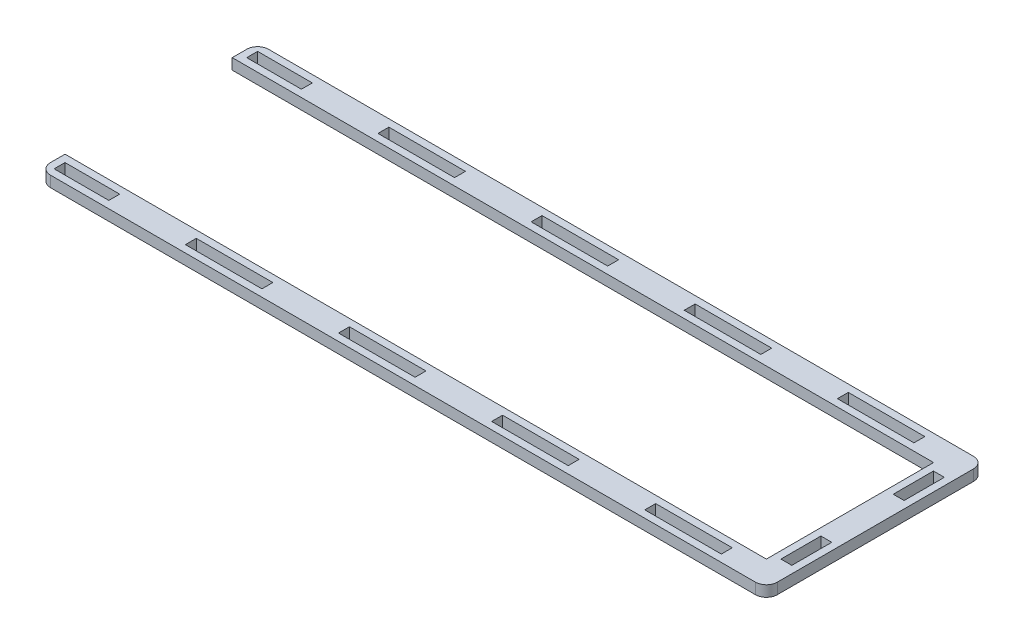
ISO-10303-21;
HEADER;
FILE_DESCRIPTION(('STEP AP214'),'2;1');
FILE_NAME('part.step','',(''),(''),'','','');
FILE_SCHEMA(('AUTOMOTIVE_DESIGN { 1 0 10303 214 1 1 1 1 }'));
ENDSEC;
DATA;
#1=APPLICATION_CONTEXT('core data for automotive mechanical design processes');
#2=APPLICATION_PROTOCOL_DEFINITION('international standard','automotive_design',2000,#1);
#3=PRODUCT_CONTEXT('',#1,'mechanical');
#4=PRODUCT('Part','Part','',(#3));
#5=PRODUCT_RELATED_PRODUCT_CATEGORY('part','',(#4));
#6=PRODUCT_DEFINITION_FORMATION('','',#4);
#7=PRODUCT_DEFINITION_CONTEXT('part definition',#1,'design');
#8=PRODUCT_DEFINITION('design','',#6,#7);
#9=PRODUCT_DEFINITION_SHAPE('','',#8);
#10=(LENGTH_UNIT() NAMED_UNIT(*) SI_UNIT(.MILLI.,.METRE.));
#11=(NAMED_UNIT(*) PLANE_ANGLE_UNIT() SI_UNIT($,.RADIAN.));
#12=(NAMED_UNIT(*) SI_UNIT($,.STERADIAN.) SOLID_ANGLE_UNIT());
#13=UNCERTAINTY_MEASURE_WITH_UNIT(LENGTH_MEASURE(1.E-05),#10,'distance_accuracy_value','');
#14=(GEOMETRIC_REPRESENTATION_CONTEXT(3) GLOBAL_UNCERTAINTY_ASSIGNED_CONTEXT((#13)) GLOBAL_UNIT_ASSIGNED_CONTEXT((#10,
#11,#12)) REPRESENTATION_CONTEXT('',''));
#15=CARTESIAN_POINT('',(0.,0.,0.));
#16=DIRECTION('',(0.,0.,1.));
#17=DIRECTION('',(1.,0.,0.));
#18=AXIS2_PLACEMENT_3D('',#15,#16,#17);
#19=CARTESIAN_POINT('',(197.,3.,57.));
#20=DIRECTION('',(0.,1.,0.));
#21=DIRECTION('',(0.,0.,1.));
#22=AXIS2_PLACEMENT_3D('',#19,#20,#21);
#23=PLANE('',#22);
#24=CARTESIAN_POINT('',(197.,3.,57.));
#25=DIRECTION('',(0.,1.,0.));
#26=DIRECTION('',(0.,0.,1.));
#27=AXIS2_PLACEMENT_3D('',#24,#25,#26);
#28=CIRCLE('',#27,3.);
#29=CARTESIAN_POINT('',(197.,3.,60.));
#30=VERTEX_POINT('',#29);
#31=CARTESIAN_POINT('',(200.,3.,57.));
#32=VERTEX_POINT('',#31);
#33=EDGE_CURVE('E786',#30,#32,#28,.T.);
#34=ORIENTED_EDGE('',*,*,#33,.T.);
#35=DIRECTION('',(0.,0.,-1.));
#36=VECTOR('',#35,1.);
#37=CARTESIAN_POINT('',(200.,3.,3.00000000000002));
#38=LINE('',#37,#36);
#39=CARTESIAN_POINT('',(200.,3.,3.00000000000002));
#40=VERTEX_POINT('',#39);
#41=EDGE_CURVE('E789',#32,#40,#38,.T.);
#42=ORIENTED_EDGE('',*,*,#41,.T.);
#43=CARTESIAN_POINT('',(197.,3.,3.));
#44=DIRECTION('',(0.,1.,0.));
#45=DIRECTION('',(0.,0.,-1.));
#46=AXIS2_PLACEMENT_3D('',#43,#44,#45);
#47=CIRCLE('',#46,3.);
#48=CARTESIAN_POINT('',(197.,3.,0.));
#49=VERTEX_POINT('',#48);
#50=EDGE_CURVE('E792',#40,#49,#47,.T.);
#51=ORIENTED_EDGE('',*,*,#50,.T.);
#52=DIRECTION('',(-1.,0.,0.));
#53=VECTOR('',#52,1.);
#54=CARTESIAN_POINT('',(3.00000000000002,3.,0.));
#55=LINE('',#54,#53);
#56=CARTESIAN_POINT('',(3.00000000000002,3.,0.));
#57=VERTEX_POINT('',#56);
#58=EDGE_CURVE('E794',#49,#57,#55,.T.);
#59=ORIENTED_EDGE('',*,*,#58,.T.);
#60=CARTESIAN_POINT('',(3.,3.,3.));
#61=DIRECTION('',(0.,1.,0.));
#62=DIRECTION('',(0.,0.,1.));
#63=AXIS2_PLACEMENT_3D('',#60,#61,#62);
#64=CIRCLE('',#63,3.);
#65=CARTESIAN_POINT('',(0.,3.,3.00000000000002));
#66=VERTEX_POINT('',#65);
#67=EDGE_CURVE('E796',#57,#66,#64,.T.);
#68=ORIENTED_EDGE('',*,*,#67,.T.);
#69=DIRECTION('',(0.,0.,1.));
#70=VECTOR('',#69,1.);
#71=CARTESIAN_POINT('',(0.,3.,3.00000000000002));
#72=LINE('',#71,#70);
#73=CARTESIAN_POINT('',(0.,3.,6.98430899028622));
#74=VERTEX_POINT('',#73);
#75=EDGE_CURVE('E798',#66,#74,#72,.T.);
#76=ORIENTED_EDGE('',*,*,#75,.T.);
#77=DIRECTION('',(1.,0.,0.));
#78=VECTOR('',#77,1.);
#79=CARTESIAN_POINT('',(0.,3.,6.98430899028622));
#80=LINE('',#79,#78);
#81=CARTESIAN_POINT('',(193.,3.,6.98430899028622));
#82=VERTEX_POINT('',#81);
#83=EDGE_CURVE('E800',#74,#82,#80,.T.);
#84=ORIENTED_EDGE('',*,*,#83,.T.);
#85=DIRECTION('',(0.,0.,1.));
#86=VECTOR('',#85,1.);
#87=CARTESIAN_POINT('',(193.,3.,53.));
#88=LINE('',#87,#86);
#89=CARTESIAN_POINT('',(193.,3.,53.));
#90=VERTEX_POINT('',#89);
#91=EDGE_CURVE('E802',#82,#90,#88,.T.);
#92=ORIENTED_EDGE('',*,*,#91,.T.);
#93=DIRECTION('',(-1.,0.,0.));
#94=VECTOR('',#93,1.);
#95=CARTESIAN_POINT('',(193.,3.,53.));
#96=LINE('',#95,#94);
#97=CARTESIAN_POINT('',(0.,3.,53.));
#98=VERTEX_POINT('',#97);
#99=EDGE_CURVE('E804',#90,#98,#96,.T.);
#100=ORIENTED_EDGE('',*,*,#99,.T.);
#101=DIRECTION('',(0.,0.,1.));
#102=VECTOR('',#101,1.);
#103=CARTESIAN_POINT('',(0.,3.,53.));
#104=LINE('',#103,#102);
#105=CARTESIAN_POINT('',(0.,3.,57.));
#106=VERTEX_POINT('',#105);
#107=EDGE_CURVE('E806',#98,#106,#104,.T.);
#108=ORIENTED_EDGE('',*,*,#107,.T.);
#109=CARTESIAN_POINT('',(3.00000000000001,3.,57.));
#110=DIRECTION('',(0.,1.,0.));
#111=DIRECTION('',(0.,0.,1.));
#112=AXIS2_PLACEMENT_3D('',#109,#110,#111);
#113=CIRCLE('',#112,3.);
#114=CARTESIAN_POINT('',(3.00000000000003,3.,60.));
#115=VERTEX_POINT('',#114);
#116=EDGE_CURVE('E808',#106,#115,#113,.T.);
#117=ORIENTED_EDGE('',*,*,#116,.T.);
#118=DIRECTION('',(1.,0.,0.));
#119=VECTOR('',#118,1.);
#120=CARTESIAN_POINT('',(3.00000000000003,3.,60.));
#121=LINE('',#120,#119);
#122=EDGE_CURVE('E810',#115,#30,#121,.T.);
#123=ORIENTED_EDGE('',*,*,#122,.T.);
#124=EDGE_LOOP('',(#34,#42,#51,#59,#68,#76,#84,#92,#100,#108,#117,#123));
#125=FACE_BOUND('',#124,.T.);
#126=DIRECTION('',(-1.,0.,0.));
#127=VECTOR('',#126,1.);
#128=CARTESIAN_POINT('',(17.0499999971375,3.,2.0000000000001));
#129=LINE('',#128,#127);
#130=CARTESIAN_POINT('',(17.0499999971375,3.,2.0000000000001));
#131=VERTEX_POINT('',#130);
#132=CARTESIAN_POINT('',(1.99999999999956,3.,2.0000000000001));
#133=VERTEX_POINT('',#132);
#134=EDGE_CURVE('E757',#131,#133,#129,.T.);
#135=ORIENTED_EDGE('',*,*,#134,.F.);
#136=DIRECTION('',(0.,0.,-1.));
#137=VECTOR('',#136,1.);
#138=CARTESIAN_POINT('',(17.0499999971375,3.,5.0000000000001));
#139=LINE('',#138,#137);
#140=CARTESIAN_POINT('',(17.0499999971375,3.,5.0000000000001));
#141=VERTEX_POINT('',#140);
#142=EDGE_CURVE('E755',#141,#131,#139,.T.);
#143=ORIENTED_EDGE('',*,*,#142,.F.);
#144=DIRECTION('',(1.,0.,0.));
#145=VECTOR('',#144,1.);
#146=CARTESIAN_POINT('',(17.0499999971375,3.,5.0000000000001));
#147=LINE('',#146,#145);
#148=CARTESIAN_POINT('',(1.99999999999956,3.,5.0000000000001));
#149=VERTEX_POINT('',#148);
#150=EDGE_CURVE('E763',#149,#141,#147,.T.);
#151=ORIENTED_EDGE('',*,*,#150,.F.);
#152=DIRECTION('',(0.,0.,1.));
#153=VECTOR('',#152,1.);
#154=CARTESIAN_POINT('',(1.99999999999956,3.,5.0000000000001));
#155=LINE('',#154,#153);
#156=EDGE_CURVE('E760',#133,#149,#155,.T.);
#157=ORIENTED_EDGE('',*,*,#156,.F.);
#158=EDGE_LOOP('',(#135,#143,#151,#157));
#159=FACE_BOUND('',#158,.T.);
#160=DIRECTION('',(1.,0.,0.));
#161=VECTOR('',#160,1.);
#162=CARTESIAN_POINT('',(38.1197999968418,3.,5.00000000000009));
#163=LINE('',#162,#161);
#164=CARTESIAN_POINT('',(38.1197999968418,3.,5.00000000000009));
#165=VERTEX_POINT('',#164);
#166=CARTESIAN_POINT('',(59.1897999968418,3.,5.0000000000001));
#167=VERTEX_POINT('',#166);
#168=EDGE_CURVE('E726',#165,#167,#163,.T.);
#169=ORIENTED_EDGE('',*,*,#168,.F.);
#170=DIRECTION('',(0.,0.,1.));
#171=VECTOR('',#170,1.);
#172=CARTESIAN_POINT('',(38.1197999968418,3.,2.0000000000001));
#173=LINE('',#172,#171);
#174=CARTESIAN_POINT('',(38.1197999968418,3.,2.0000000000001));
#175=VERTEX_POINT('',#174);
#176=EDGE_CURVE('E724',#175,#165,#173,.T.);
#177=ORIENTED_EDGE('',*,*,#176,.F.);
#178=DIRECTION('',(-1.,0.,0.));
#179=VECTOR('',#178,1.);
#180=CARTESIAN_POINT('',(38.1197999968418,3.,2.0000000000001));
#181=LINE('',#180,#179);
#182=CARTESIAN_POINT('',(59.1897999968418,3.,2.00000000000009));
#183=VERTEX_POINT('',#182);
#184=EDGE_CURVE('E732',#183,#175,#181,.T.);
#185=ORIENTED_EDGE('',*,*,#184,.F.);
#186=DIRECTION('',(0.,0.,-1.));
#187=VECTOR('',#186,1.);
#188=CARTESIAN_POINT('',(59.1897999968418,3.,2.00000000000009));
#189=LINE('',#188,#187);
#190=EDGE_CURVE('E729',#167,#183,#189,.T.);
#191=ORIENTED_EDGE('',*,*,#190,.F.);
#192=EDGE_LOOP('',(#169,#177,#185,#191));
#193=FACE_BOUND('',#192,.T.);
#194=DIRECTION('',(1.,0.,0.));
#195=VECTOR('',#194,1.);
#196=CARTESIAN_POINT('',(80.2596999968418,3.,5.00000000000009));
#197=LINE('',#196,#195);
#198=CARTESIAN_POINT('',(80.2596999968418,3.,5.00000000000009));
#199=VERTEX_POINT('',#198);
#200=CARTESIAN_POINT('',(101.329399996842,3.,5.0000000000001));
#201=VERTEX_POINT('',#200);
#202=EDGE_CURVE('E695',#199,#201,#197,.T.);
#203=ORIENTED_EDGE('',*,*,#202,.F.);
#204=DIRECTION('',(0.,0.,1.));
#205=VECTOR('',#204,1.);
#206=CARTESIAN_POINT('',(80.2596999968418,3.,2.0000000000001));
#207=LINE('',#206,#205);
#208=CARTESIAN_POINT('',(80.2596999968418,3.,2.0000000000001));
#209=VERTEX_POINT('',#208);
#210=EDGE_CURVE('E693',#209,#199,#207,.T.);
#211=ORIENTED_EDGE('',*,*,#210,.F.);
#212=DIRECTION('',(-1.,0.,0.));
#213=VECTOR('',#212,1.);
#214=CARTESIAN_POINT('',(80.2596999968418,3.,2.0000000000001));
#215=LINE('',#214,#213);
#216=CARTESIAN_POINT('',(101.329399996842,3.,2.00000000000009));
#217=VERTEX_POINT('',#216);
#218=EDGE_CURVE('E701',#217,#209,#215,.T.);
#219=ORIENTED_EDGE('',*,*,#218,.F.);
#220=DIRECTION('',(0.,0.,-1.));
#221=VECTOR('',#220,1.);
#222=CARTESIAN_POINT('',(101.329399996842,3.,2.00000000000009));
#223=LINE('',#222,#221);
#224=EDGE_CURVE('E698',#201,#217,#223,.T.);
#225=ORIENTED_EDGE('',*,*,#224,.F.);
#226=EDGE_LOOP('',(#203,#211,#219,#225));
#227=FACE_BOUND('',#226,.T.);
#228=DIRECTION('',(1.,0.,0.));
#229=VECTOR('',#228,1.);
#230=CARTESIAN_POINT('',(122.399499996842,3.,5.0000000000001));
#231=LINE('',#230,#229);
#232=CARTESIAN_POINT('',(122.399499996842,3.,5.0000000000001));
#233=VERTEX_POINT('',#232);
#234=CARTESIAN_POINT('',(143.469199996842,3.,5.0000000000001));
#235=VERTEX_POINT('',#234);
#236=EDGE_CURVE('E664',#233,#235,#231,.T.);
#237=ORIENTED_EDGE('',*,*,#236,.F.);
#238=DIRECTION('',(0.,0.,1.));
#239=VECTOR('',#238,1.);
#240=CARTESIAN_POINT('',(122.399499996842,3.,2.0000000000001));
#241=LINE('',#240,#239);
#242=CARTESIAN_POINT('',(122.399499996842,3.,2.0000000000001));
#243=VERTEX_POINT('',#242);
#244=EDGE_CURVE('E662',#243,#233,#241,.T.);
#245=ORIENTED_EDGE('',*,*,#244,.F.);
#246=DIRECTION('',(-1.,0.,0.));
#247=VECTOR('',#246,1.);
#248=CARTESIAN_POINT('',(122.399499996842,3.,2.0000000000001));
#249=LINE('',#248,#247);
#250=CARTESIAN_POINT('',(143.469199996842,3.,2.0000000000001));
#251=VERTEX_POINT('',#250);
#252=EDGE_CURVE('E670',#251,#243,#249,.T.);
#253=ORIENTED_EDGE('',*,*,#252,.F.);
#254=DIRECTION('',(0.,0.,-1.));
#255=VECTOR('',#254,1.);
#256=CARTESIAN_POINT('',(143.469199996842,3.,2.0000000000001));
#257=LINE('',#256,#255);
#258=EDGE_CURVE('E667',#235,#251,#257,.T.);
#259=ORIENTED_EDGE('',*,*,#258,.F.);
#260=EDGE_LOOP('',(#237,#245,#253,#259));
#261=FACE_BOUND('',#260,.T.);
#262=DIRECTION('',(1.,0.,0.));
#263=VECTOR('',#262,1.);
#264=CARTESIAN_POINT('',(164.539199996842,3.,5.00000000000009));
#265=LINE('',#264,#263);
#266=CARTESIAN_POINT('',(164.539199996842,3.,5.00000000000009));
#267=VERTEX_POINT('',#266);
#268=CARTESIAN_POINT('',(185.6088,3.,5.00000000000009));
#269=VERTEX_POINT('',#268);
#270=EDGE_CURVE('E633',#267,#269,#265,.T.);
#271=ORIENTED_EDGE('',*,*,#270,.F.);
#272=DIRECTION('',(0.,0.,1.));
#273=VECTOR('',#272,1.);
#274=CARTESIAN_POINT('',(164.539199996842,3.,2.00000000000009));
#275=LINE('',#274,#273);
#276=CARTESIAN_POINT('',(164.539199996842,3.,2.00000000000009));
#277=VERTEX_POINT('',#276);
#278=EDGE_CURVE('E631',#277,#267,#275,.T.);
#279=ORIENTED_EDGE('',*,*,#278,.F.);
#280=DIRECTION('',(-1.,0.,0.));
#281=VECTOR('',#280,1.);
#282=CARTESIAN_POINT('',(164.539199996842,3.,2.00000000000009));
#283=LINE('',#282,#281);
#284=CARTESIAN_POINT('',(185.6088,3.,2.00000000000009));
#285=VERTEX_POINT('',#284);
#286=EDGE_CURVE('E639',#285,#277,#283,.T.);
#287=ORIENTED_EDGE('',*,*,#286,.F.);
#288=DIRECTION('',(0.,0.,-1.));
#289=VECTOR('',#288,1.);
#290=CARTESIAN_POINT('',(185.6088,3.,2.00000000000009));
#291=LINE('',#290,#289);
#292=EDGE_CURVE('E636',#269,#285,#291,.T.);
#293=ORIENTED_EDGE('',*,*,#292,.F.);
#294=EDGE_LOOP('',(#271,#279,#287,#293));
#295=FACE_BOUND('',#294,.T.);
#296=DIRECTION('',(1.,0.,0.));
#297=VECTOR('',#296,1.);
#298=CARTESIAN_POINT('',(195.,3.,20.0897214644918));
#299=LINE('',#298,#297);
#300=CARTESIAN_POINT('',(195.,3.,20.0897214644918));
#301=VERTEX_POINT('',#300);
#302=CARTESIAN_POINT('',(198.,3.,20.0897214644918));
#303=VERTEX_POINT('',#302);
#304=EDGE_CURVE('E602',#301,#303,#299,.T.);
#305=ORIENTED_EDGE('',*,*,#304,.F.);
#306=DIRECTION('',(0.,0.,1.));
#307=VECTOR('',#306,1.);
#308=CARTESIAN_POINT('',(195.,3.,9.02496840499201));
#309=LINE('',#308,#307);
#310=CARTESIAN_POINT('',(195.,3.,9.02496840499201));
#311=VERTEX_POINT('',#310);
#312=EDGE_CURVE('E600',#311,#301,#309,.T.);
#313=ORIENTED_EDGE('',*,*,#312,.F.);
#314=DIRECTION('',(-1.,0.,0.));
#315=VECTOR('',#314,1.);
#316=CARTESIAN_POINT('',(195.,3.,9.02496840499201));
#317=LINE('',#316,#315);
#318=CARTESIAN_POINT('',(198.,3.,9.02496840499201));
#319=VERTEX_POINT('',#318);
#320=EDGE_CURVE('E608',#319,#311,#317,.T.);
#321=ORIENTED_EDGE('',*,*,#320,.F.);
#322=DIRECTION('',(0.,0.,-1.));
#323=VECTOR('',#322,1.);
#324=CARTESIAN_POINT('',(198.,3.,9.02496840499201));
#325=LINE('',#324,#323);
#326=EDGE_CURVE('E605',#303,#319,#325,.T.);
#327=ORIENTED_EDGE('',*,*,#326,.F.);
#328=EDGE_LOOP('',(#305,#313,#321,#327));
#329=FACE_BOUND('',#328,.T.);
#330=DIRECTION('',(1.,0.,0.));
#331=VECTOR('',#330,1.);
#332=CARTESIAN_POINT('',(195.,3.,51.0000000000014));
#333=LINE('',#332,#331);
#334=CARTESIAN_POINT('',(195.,3.,51.0000000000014));
#335=VERTEX_POINT('',#334);
#336=CARTESIAN_POINT('',(198.,3.,51.0000000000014));
#337=VERTEX_POINT('',#336);
#338=EDGE_CURVE('E571',#335,#337,#333,.T.);
#339=ORIENTED_EDGE('',*,*,#338,.F.);
#340=DIRECTION('',(0.,0.,1.));
#341=VECTOR('',#340,1.);
#342=CARTESIAN_POINT('',(195.,3.,40.));
#343=LINE('',#342,#341);
#344=CARTESIAN_POINT('',(195.,3.,40.));
#345=VERTEX_POINT('',#344);
#346=EDGE_CURVE('E569',#345,#335,#343,.T.);
#347=ORIENTED_EDGE('',*,*,#346,.F.);
#348=DIRECTION('',(-1.,0.,0.));
#349=VECTOR('',#348,1.);
#350=CARTESIAN_POINT('',(195.,3.,40.));
#351=LINE('',#350,#349);
#352=CARTESIAN_POINT('',(198.,3.,40.));
#353=VERTEX_POINT('',#352);
#354=EDGE_CURVE('E577',#353,#345,#351,.T.);
#355=ORIENTED_EDGE('',*,*,#354,.F.);
#356=DIRECTION('',(0.,0.,-1.));
#357=VECTOR('',#356,1.);
#358=CARTESIAN_POINT('',(198.,3.,40.));
#359=LINE('',#358,#357);
#360=EDGE_CURVE('E574',#337,#353,#359,.T.);
#361=ORIENTED_EDGE('',*,*,#360,.F.);
#362=EDGE_LOOP('',(#339,#347,#355,#361));
#363=FACE_BOUND('',#362,.T.);
#364=DIRECTION('',(-1.,0.,0.));
#365=VECTOR('',#364,1.);
#366=CARTESIAN_POINT('',(185.6088,3.,55.));
#367=LINE('',#366,#365);
#368=CARTESIAN_POINT('',(185.6088,3.,55.));
#369=VERTEX_POINT('',#368);
#370=CARTESIAN_POINT('',(164.5391,3.,55.));
#371=VERTEX_POINT('',#370);
#372=EDGE_CURVE('E540',#369,#371,#367,.T.);
#373=ORIENTED_EDGE('',*,*,#372,.F.);
#374=DIRECTION('',(0.,0.,-1.));
#375=VECTOR('',#374,1.);
#376=CARTESIAN_POINT('',(185.6088,3.,55.));
#377=LINE('',#376,#375);
#378=CARTESIAN_POINT('',(185.6088,3.,58.));
#379=VERTEX_POINT('',#378);
#380=EDGE_CURVE('E538',#379,#369,#377,.T.);
#381=ORIENTED_EDGE('',*,*,#380,.F.);
#382=DIRECTION('',(1.,0.,0.));
#383=VECTOR('',#382,1.);
#384=CARTESIAN_POINT('',(185.6088,3.,58.));
#385=LINE('',#384,#383);
#386=CARTESIAN_POINT('',(164.5391,3.,58.));
#387=VERTEX_POINT('',#386);
#388=EDGE_CURVE('E546',#387,#379,#385,.T.);
#389=ORIENTED_EDGE('',*,*,#388,.F.);
#390=DIRECTION('',(0.,0.,1.));
#391=VECTOR('',#390,1.);
#392=CARTESIAN_POINT('',(164.5391,3.,55.));
#393=LINE('',#392,#391);
#394=EDGE_CURVE('E543',#371,#387,#393,.T.);
#395=ORIENTED_EDGE('',*,*,#394,.F.);
#396=EDGE_LOOP('',(#373,#381,#389,#395));
#397=FACE_BOUND('',#396,.T.);
#398=DIRECTION('',(-1.,0.,0.));
#399=VECTOR('',#398,1.);
#400=CARTESIAN_POINT('',(143.4691,3.,55.));
#401=LINE('',#400,#399);
#402=CARTESIAN_POINT('',(143.4691,3.,55.));
#403=VERTEX_POINT('',#402);
#404=CARTESIAN_POINT('',(122.3994,3.,55.));
#405=VERTEX_POINT('',#404);
#406=EDGE_CURVE('E509',#403,#405,#401,.T.);
#407=ORIENTED_EDGE('',*,*,#406,.F.);
#408=DIRECTION('',(0.,0.,-1.));
#409=VECTOR('',#408,1.);
#410=CARTESIAN_POINT('',(143.4691,3.,55.));
#411=LINE('',#410,#409);
#412=CARTESIAN_POINT('',(143.4691,3.,58.));
#413=VERTEX_POINT('',#412);
#414=EDGE_CURVE('E507',#413,#403,#411,.T.);
#415=ORIENTED_EDGE('',*,*,#414,.F.);
#416=DIRECTION('',(1.,0.,0.));
#417=VECTOR('',#416,1.);
#418=CARTESIAN_POINT('',(143.4691,3.,58.));
#419=LINE('',#418,#417);
#420=CARTESIAN_POINT('',(122.3994,3.,58.));
#421=VERTEX_POINT('',#420);
#422=EDGE_CURVE('E515',#421,#413,#419,.T.);
#423=ORIENTED_EDGE('',*,*,#422,.F.);
#424=DIRECTION('',(0.,0.,1.));
#425=VECTOR('',#424,1.);
#426=CARTESIAN_POINT('',(122.3994,3.,55.));
#427=LINE('',#426,#425);
#428=EDGE_CURVE('E512',#405,#421,#427,.T.);
#429=ORIENTED_EDGE('',*,*,#428,.F.);
#430=EDGE_LOOP('',(#407,#415,#423,#429));
#431=FACE_BOUND('',#430,.T.);
#432=DIRECTION('',(-1.,0.,0.));
#433=VECTOR('',#432,1.);
#434=CARTESIAN_POINT('',(101.3293,3.,55.));
#435=LINE('',#434,#433);
#436=CARTESIAN_POINT('',(101.3293,3.,55.));
#437=VERTEX_POINT('',#436);
#438=CARTESIAN_POINT('',(80.2596,3.,55.));
#439=VERTEX_POINT('',#438);
#440=EDGE_CURVE('E478',#437,#439,#435,.T.);
#441=ORIENTED_EDGE('',*,*,#440,.F.);
#442=DIRECTION('',(0.,0.,-1.));
#443=VECTOR('',#442,1.);
#444=CARTESIAN_POINT('',(101.3293,3.,55.));
#445=LINE('',#444,#443);
#446=CARTESIAN_POINT('',(101.3293,3.,58.));
#447=VERTEX_POINT('',#446);
#448=EDGE_CURVE('E476',#447,#437,#445,.T.);
#449=ORIENTED_EDGE('',*,*,#448,.F.);
#450=DIRECTION('',(1.,0.,0.));
#451=VECTOR('',#450,1.);
#452=CARTESIAN_POINT('',(101.3293,3.,58.));
#453=LINE('',#452,#451);
#454=CARTESIAN_POINT('',(80.2596,3.,58.));
#455=VERTEX_POINT('',#454);
#456=EDGE_CURVE('E484',#455,#447,#453,.T.);
#457=ORIENTED_EDGE('',*,*,#456,.F.);
#458=DIRECTION('',(0.,0.,1.));
#459=VECTOR('',#458,1.);
#460=CARTESIAN_POINT('',(80.2596,3.,55.));
#461=LINE('',#460,#459);
#462=EDGE_CURVE('E481',#439,#455,#461,.T.);
#463=ORIENTED_EDGE('',*,*,#462,.F.);
#464=EDGE_LOOP('',(#441,#449,#457,#463));
#465=FACE_BOUND('',#464,.T.);
#466=DIRECTION('',(-1.,0.,0.));
#467=VECTOR('',#466,1.);
#468=CARTESIAN_POINT('',(59.1897,3.,55.));
#469=LINE('',#468,#467);
#470=CARTESIAN_POINT('',(59.1897,3.,55.));
#471=VERTEX_POINT('',#470);
#472=CARTESIAN_POINT('',(38.1197,3.,55.));
#473=VERTEX_POINT('',#472);
#474=EDGE_CURVE('E447',#471,#473,#469,.T.);
#475=ORIENTED_EDGE('',*,*,#474,.F.);
#476=DIRECTION('',(0.,0.,-1.));
#477=VECTOR('',#476,1.);
#478=CARTESIAN_POINT('',(59.1897,3.,55.));
#479=LINE('',#478,#477);
#480=CARTESIAN_POINT('',(59.1897,3.,58.));
#481=VERTEX_POINT('',#480);
#482=EDGE_CURVE('E445',#481,#471,#479,.T.);
#483=ORIENTED_EDGE('',*,*,#482,.F.);
#484=DIRECTION('',(1.,0.,0.));
#485=VECTOR('',#484,1.);
#486=CARTESIAN_POINT('',(59.1897,3.,58.));
#487=LINE('',#486,#485);
#488=CARTESIAN_POINT('',(38.1197,3.,58.));
#489=VERTEX_POINT('',#488);
#490=EDGE_CURVE('E453',#489,#481,#487,.T.);
#491=ORIENTED_EDGE('',*,*,#490,.F.);
#492=DIRECTION('',(0.,0.,1.));
#493=VECTOR('',#492,1.);
#494=CARTESIAN_POINT('',(38.1197,3.,55.));
#495=LINE('',#494,#493);
#496=EDGE_CURVE('E450',#473,#489,#495,.T.);
#497=ORIENTED_EDGE('',*,*,#496,.F.);
#498=EDGE_LOOP('',(#475,#483,#491,#497));
#499=FACE_BOUND('',#498,.T.);
#500=DIRECTION('',(-1.,0.,0.));
#501=VECTOR('',#500,1.);
#502=CARTESIAN_POINT('',(17.0499,3.,55.));
#503=LINE('',#502,#501);
#504=CARTESIAN_POINT('',(17.0499,3.,55.));
#505=VERTEX_POINT('',#504);
#506=CARTESIAN_POINT('',(2.,3.,55.));
#507=VERTEX_POINT('',#506);
#508=EDGE_CURVE('E417',#505,#507,#503,.T.);
#509=ORIENTED_EDGE('',*,*,#508,.F.);
#510=DIRECTION('',(0.,0.,-1.));
#511=VECTOR('',#510,1.);
#512=CARTESIAN_POINT('',(17.0499,3.,55.));
#513=LINE('',#512,#511);
#514=CARTESIAN_POINT('',(17.0499,3.,58.));
#515=VERTEX_POINT('',#514);
#516=EDGE_CURVE('E409',#515,#505,#513,.T.);
#517=ORIENTED_EDGE('',*,*,#516,.F.);
#518=DIRECTION('',(1.,0.,0.));
#519=VECTOR('',#518,1.);
#520=CARTESIAN_POINT('',(17.0499,3.,58.));
#521=LINE('',#520,#519);
#522=CARTESIAN_POINT('',(2.,3.,58.));
#523=VERTEX_POINT('',#522);
#524=EDGE_CURVE('E431',#523,#515,#521,.T.);
#525=ORIENTED_EDGE('',*,*,#524,.F.);
#526=DIRECTION('',(0.,0.,1.));
#527=VECTOR('',#526,1.);
#528=CARTESIAN_POINT('',(2.,3.,55.));
#529=LINE('',#528,#527);
#530=EDGE_CURVE('E429',#507,#523,#529,.T.);
#531=ORIENTED_EDGE('',*,*,#530,.F.);
#532=EDGE_LOOP('',(#509,#517,#525,#531));
#533=FACE_BOUND('',#532,.T.);
#534=ADVANCED_FACE('F32',(#125,#159,#193,#227,#261,#295,#329,#363,#397,#431,#465,#499,#533),#23,.T.);
#535=CARTESIAN_POINT('',(197.,0.,57.));
#536=DIRECTION('',(0.,1.,0.));
#537=DIRECTION('',(0.,0.,1.));
#538=AXIS2_PLACEMENT_3D('',#535,#536,#537);
#539=PLANE('',#538);
#540=DIRECTION('',(0.,0.,-1.));
#541=VECTOR('',#540,1.);
#542=CARTESIAN_POINT('',(59.1897,0.,55.));
#543=LINE('',#542,#541);
#544=CARTESIAN_POINT('',(59.1897,0.,58.));
#545=VERTEX_POINT('',#544);
#546=CARTESIAN_POINT('',(59.1897,0.,55.));
#547=VERTEX_POINT('',#546);
#548=EDGE_CURVE('E425',#545,#547,#543,.T.);
#549=ORIENTED_EDGE('',*,*,#548,.T.);
#550=DIRECTION('',(-1.,0.,0.));
#551=VECTOR('',#550,1.);
#552=CARTESIAN_POINT('',(59.1897,0.,55.));
#553=LINE('',#552,#551);
#554=CARTESIAN_POINT('',(38.1197,0.,55.));
#555=VERTEX_POINT('',#554);
#556=EDGE_CURVE('E458',#547,#555,#553,.T.);
#557=ORIENTED_EDGE('',*,*,#556,.T.);
#558=DIRECTION('',(0.,0.,1.));
#559=VECTOR('',#558,1.);
#560=CARTESIAN_POINT('',(38.1197,0.,55.));
#561=LINE('',#560,#559);
#562=CARTESIAN_POINT('',(38.1197,0.,58.));
#563=VERTEX_POINT('',#562);
#564=EDGE_CURVE('E461',#555,#563,#561,.T.);
#565=ORIENTED_EDGE('',*,*,#564,.T.);
#566=DIRECTION('',(1.,0.,0.));
#567=VECTOR('',#566,1.);
#568=CARTESIAN_POINT('',(59.1897,0.,58.));
#569=LINE('',#568,#567);
#570=EDGE_CURVE('E448',#563,#545,#569,.T.);
#571=ORIENTED_EDGE('',*,*,#570,.T.);
#572=EDGE_LOOP('',(#549,#557,#565,#571));
#573=FACE_BOUND('',#572,.T.);
#574=DIRECTION('',(0.,0.,-1.));
#575=VECTOR('',#574,1.);
#576=CARTESIAN_POINT('',(143.4691,0.,55.));
#577=LINE('',#576,#575);
#578=CARTESIAN_POINT('',(143.4691,0.,58.));
#579=VERTEX_POINT('',#578);
#580=CARTESIAN_POINT('',(143.4691,0.,55.));
#581=VERTEX_POINT('',#580);
#582=EDGE_CURVE('E506',#579,#581,#577,.T.);
#583=ORIENTED_EDGE('',*,*,#582,.T.);
#584=DIRECTION('',(-1.,0.,0.));
#585=VECTOR('',#584,1.);
#586=CARTESIAN_POINT('',(143.4691,0.,55.));
#587=LINE('',#586,#585);
#588=CARTESIAN_POINT('',(122.3994,0.,55.));
#589=VERTEX_POINT('',#588);
#590=EDGE_CURVE('E520',#581,#589,#587,.T.);
#591=ORIENTED_EDGE('',*,*,#590,.T.);
#592=DIRECTION('',(0.,0.,1.));
#593=VECTOR('',#592,1.);
#594=CARTESIAN_POINT('',(122.3994,0.,55.));
#595=LINE('',#594,#593);
#596=CARTESIAN_POINT('',(122.3994,0.,58.));
#597=VERTEX_POINT('',#596);
#598=EDGE_CURVE('E523',#589,#597,#595,.T.);
#599=ORIENTED_EDGE('',*,*,#598,.T.);
#600=DIRECTION('',(1.,0.,0.));
#601=VECTOR('',#600,1.);
#602=CARTESIAN_POINT('',(143.4691,0.,58.));
#603=LINE('',#602,#601);
#604=EDGE_CURVE('E510',#597,#579,#603,.T.);
#605=ORIENTED_EDGE('',*,*,#604,.T.);
#606=EDGE_LOOP('',(#583,#591,#599,#605));
#607=FACE_BOUND('',#606,.T.);
#608=DIRECTION('',(0.,0.,1.));
#609=VECTOR('',#608,1.);
#610=CARTESIAN_POINT('',(195.,0.,40.));
#611=LINE('',#610,#609);
#612=CARTESIAN_POINT('',(195.,0.,40.));
#613=VERTEX_POINT('',#612);
#614=CARTESIAN_POINT('',(195.,0.,51.0000000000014));
#615=VERTEX_POINT('',#614);
#616=EDGE_CURVE('E568',#613,#615,#611,.T.);
#617=ORIENTED_EDGE('',*,*,#616,.T.);
#618=DIRECTION('',(1.,0.,0.));
#619=VECTOR('',#618,1.);
#620=CARTESIAN_POINT('',(195.,0.,51.0000000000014));
#621=LINE('',#620,#619);
#622=CARTESIAN_POINT('',(198.,0.,51.0000000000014));
#623=VERTEX_POINT('',#622);
#624=EDGE_CURVE('E582',#615,#623,#621,.T.);
#625=ORIENTED_EDGE('',*,*,#624,.T.);
#626=DIRECTION('',(0.,0.,-1.));
#627=VECTOR('',#626,1.);
#628=CARTESIAN_POINT('',(198.,0.,40.));
#629=LINE('',#628,#627);
#630=CARTESIAN_POINT('',(198.,0.,40.));
#631=VERTEX_POINT('',#630);
#632=EDGE_CURVE('E585',#623,#631,#629,.T.);
#633=ORIENTED_EDGE('',*,*,#632,.T.);
#634=DIRECTION('',(-1.,0.,0.));
#635=VECTOR('',#634,1.);
#636=CARTESIAN_POINT('',(195.,0.,40.));
#637=LINE('',#636,#635);
#638=EDGE_CURVE('E572',#631,#613,#637,.T.);
#639=ORIENTED_EDGE('',*,*,#638,.T.);
#640=EDGE_LOOP('',(#617,#625,#633,#639));
#641=FACE_BOUND('',#640,.T.);
#642=DIRECTION('',(0.,0.,1.));
#643=VECTOR('',#642,1.);
#644=CARTESIAN_POINT('',(164.539199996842,0.,2.00000000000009));
#645=LINE('',#644,#643);
#646=CARTESIAN_POINT('',(164.539199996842,0.,2.00000000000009));
#647=VERTEX_POINT('',#646);
#648=CARTESIAN_POINT('',(164.539199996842,0.,5.00000000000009));
#649=VERTEX_POINT('',#648);
#650=EDGE_CURVE('E630',#647,#649,#645,.T.);
#651=ORIENTED_EDGE('',*,*,#650,.T.);
#652=DIRECTION('',(1.,0.,0.));
#653=VECTOR('',#652,1.);
#654=CARTESIAN_POINT('',(164.539199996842,0.,5.00000000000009));
#655=LINE('',#654,#653);
#656=CARTESIAN_POINT('',(185.6088,0.,5.00000000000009));
#657=VERTEX_POINT('',#656);
#658=EDGE_CURVE('E644',#649,#657,#655,.T.);
#659=ORIENTED_EDGE('',*,*,#658,.T.);
#660=DIRECTION('',(0.,0.,-1.));
#661=VECTOR('',#660,1.);
#662=CARTESIAN_POINT('',(185.6088,0.,2.00000000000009));
#663=LINE('',#662,#661);
#664=CARTESIAN_POINT('',(185.6088,0.,2.00000000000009));
#665=VERTEX_POINT('',#664);
#666=EDGE_CURVE('E647',#657,#665,#663,.T.);
#667=ORIENTED_EDGE('',*,*,#666,.T.);
#668=DIRECTION('',(-1.,0.,0.));
#669=VECTOR('',#668,1.);
#670=CARTESIAN_POINT('',(164.539199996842,0.,2.00000000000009));
#671=LINE('',#670,#669);
#672=EDGE_CURVE('E634',#665,#647,#671,.T.);
#673=ORIENTED_EDGE('',*,*,#672,.T.);
#674=EDGE_LOOP('',(#651,#659,#667,#673));
#675=FACE_BOUND('',#674,.T.);
#676=DIRECTION('',(0.,0.,1.));
#677=VECTOR('',#676,1.);
#678=CARTESIAN_POINT('',(80.2596999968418,0.,2.0000000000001));
#679=LINE('',#678,#677);
#680=CARTESIAN_POINT('',(80.2596999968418,0.,2.0000000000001));
#681=VERTEX_POINT('',#680);
#682=CARTESIAN_POINT('',(80.2596999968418,0.,5.00000000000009));
#683=VERTEX_POINT('',#682);
#684=EDGE_CURVE('E692',#681,#683,#679,.T.);
#685=ORIENTED_EDGE('',*,*,#684,.T.);
#686=DIRECTION('',(1.,0.,0.));
#687=VECTOR('',#686,1.);
#688=CARTESIAN_POINT('',(80.2596999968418,0.,5.00000000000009));
#689=LINE('',#688,#687);
#690=CARTESIAN_POINT('',(101.329399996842,0.,5.0000000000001));
#691=VERTEX_POINT('',#690);
#692=EDGE_CURVE('E706',#683,#691,#689,.T.);
#693=ORIENTED_EDGE('',*,*,#692,.T.);
#694=DIRECTION('',(0.,0.,-1.));
#695=VECTOR('',#694,1.);
#696=CARTESIAN_POINT('',(101.329399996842,0.,2.00000000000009));
#697=LINE('',#696,#695);
#698=CARTESIAN_POINT('',(101.329399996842,0.,2.00000000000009));
#699=VERTEX_POINT('',#698);
#700=EDGE_CURVE('E709',#691,#699,#697,.T.);
#701=ORIENTED_EDGE('',*,*,#700,.T.);
#702=DIRECTION('',(-1.,0.,0.));
#703=VECTOR('',#702,1.);
#704=CARTESIAN_POINT('',(80.2596999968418,0.,2.0000000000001));
#705=LINE('',#704,#703);
#706=EDGE_CURVE('E696',#699,#681,#705,.T.);
#707=ORIENTED_EDGE('',*,*,#706,.T.);
#708=EDGE_LOOP('',(#685,#693,#701,#707));
#709=FACE_BOUND('',#708,.T.);
#710=DIRECTION('',(0.,0.,-1.));
#711=VECTOR('',#710,1.);
#712=CARTESIAN_POINT('',(17.0499999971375,0.,5.0000000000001));
#713=LINE('',#712,#711);
#714=CARTESIAN_POINT('',(17.0499999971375,0.,5.0000000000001));
#715=VERTEX_POINT('',#714);
#716=CARTESIAN_POINT('',(17.0499999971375,0.,2.0000000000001));
#717=VERTEX_POINT('',#716);
#718=EDGE_CURVE('E754',#715,#717,#713,.T.);
#719=ORIENTED_EDGE('',*,*,#718,.T.);
#720=DIRECTION('',(-1.,0.,0.));
#721=VECTOR('',#720,1.);
#722=CARTESIAN_POINT('',(17.0499999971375,0.,2.0000000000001));
#723=LINE('',#722,#721);
#724=CARTESIAN_POINT('',(1.99999999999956,0.,2.0000000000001));
#725=VERTEX_POINT('',#724);
#726=EDGE_CURVE('E768',#717,#725,#723,.T.);
#727=ORIENTED_EDGE('',*,*,#726,.T.);
#728=DIRECTION('',(0.,0.,1.));
#729=VECTOR('',#728,1.);
#730=CARTESIAN_POINT('',(1.99999999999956,0.,5.0000000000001));
#731=LINE('',#730,#729);
#732=CARTESIAN_POINT('',(1.99999999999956,0.,5.0000000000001));
#733=VERTEX_POINT('',#732);
#734=EDGE_CURVE('E771',#725,#733,#731,.T.);
#735=ORIENTED_EDGE('',*,*,#734,.T.);
#736=DIRECTION('',(1.,0.,0.));
#737=VECTOR('',#736,1.);
#738=CARTESIAN_POINT('',(17.0499999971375,0.,5.0000000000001));
#739=LINE('',#738,#737);
#740=EDGE_CURVE('E758',#733,#715,#739,.T.);
#741=ORIENTED_EDGE('',*,*,#740,.T.);
#742=EDGE_LOOP('',(#719,#727,#735,#741));
#743=FACE_BOUND('',#742,.T.);
#744=CARTESIAN_POINT('',(197.,0.,57.));
#745=DIRECTION('',(0.,1.,0.));
#746=DIRECTION('',(0.,0.,1.));
#747=AXIS2_PLACEMENT_3D('',#744,#745,#746);
#748=CIRCLE('',#747,3.);
#749=CARTESIAN_POINT('',(197.,0.,60.));
#750=VERTEX_POINT('',#749);
#751=CARTESIAN_POINT('',(200.,0.,57.));
#752=VERTEX_POINT('',#751);
#753=EDGE_CURVE('E785',#750,#752,#748,.T.);
#754=ORIENTED_EDGE('',*,*,#753,.F.);
#755=DIRECTION('',(1.,0.,0.));
#756=VECTOR('',#755,1.);
#757=CARTESIAN_POINT('',(3.00000000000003,0.,60.));
#758=LINE('',#757,#756);
#759=CARTESIAN_POINT('',(3.00000000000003,0.,60.));
#760=VERTEX_POINT('',#759);
#761=EDGE_CURVE('E790',#760,#750,#758,.T.);
#762=ORIENTED_EDGE('',*,*,#761,.F.);
#763=CARTESIAN_POINT('',(3.00000000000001,0.,57.));
#764=DIRECTION('',(0.,1.,0.));
#765=DIRECTION('',(0.,0.,1.));
#766=AXIS2_PLACEMENT_3D('',#763,#764,#765);
#767=CIRCLE('',#766,3.);
#768=CARTESIAN_POINT('',(0.,0.,57.));
#769=VERTEX_POINT('',#768);
#770=EDGE_CURVE('E833',#769,#760,#767,.T.);
#771=ORIENTED_EDGE('',*,*,#770,.F.);
#772=DIRECTION('',(0.,0.,1.));
#773=VECTOR('',#772,1.);
#774=CARTESIAN_POINT('',(0.,0.,53.));
#775=LINE('',#774,#773);
#776=CARTESIAN_POINT('',(0.,0.,53.));
#777=VERTEX_POINT('',#776);
#778=EDGE_CURVE('E831',#777,#769,#775,.T.);
#779=ORIENTED_EDGE('',*,*,#778,.F.);
#780=DIRECTION('',(-1.,0.,0.));
#781=VECTOR('',#780,1.);
#782=CARTESIAN_POINT('',(193.,0.,53.));
#783=LINE('',#782,#781);
#784=CARTESIAN_POINT('',(193.,0.,53.));
#785=VERTEX_POINT('',#784);
#786=EDGE_CURVE('E829',#785,#777,#783,.T.);
#787=ORIENTED_EDGE('',*,*,#786,.F.);
#788=DIRECTION('',(0.,0.,1.));
#789=VECTOR('',#788,1.);
#790=CARTESIAN_POINT('',(193.,0.,53.));
#791=LINE('',#790,#789);
#792=CARTESIAN_POINT('',(193.,0.,6.98430899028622));
#793=VERTEX_POINT('',#792);
#794=EDGE_CURVE('E827',#793,#785,#791,.T.);
#795=ORIENTED_EDGE('',*,*,#794,.F.);
#796=DIRECTION('',(1.,0.,0.));
#797=VECTOR('',#796,1.);
#798=CARTESIAN_POINT('',(0.,0.,6.98430899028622));
#799=LINE('',#798,#797);
#800=CARTESIAN_POINT('',(0.,0.,6.98430899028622));
#801=VERTEX_POINT('',#800);
#802=EDGE_CURVE('E825',#801,#793,#799,.T.);
#803=ORIENTED_EDGE('',*,*,#802,.F.);
#804=DIRECTION('',(0.,0.,1.));
#805=VECTOR('',#804,1.);
#806=CARTESIAN_POINT('',(0.,0.,3.00000000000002));
#807=LINE('',#806,#805);
#808=CARTESIAN_POINT('',(0.,0.,3.00000000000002));
#809=VERTEX_POINT('',#808);
#810=EDGE_CURVE('E823',#809,#801,#807,.T.);
#811=ORIENTED_EDGE('',*,*,#810,.F.);
#812=CARTESIAN_POINT('',(3.,0.,3.));
#813=DIRECTION('',(0.,1.,0.));
#814=DIRECTION('',(0.,0.,1.));
#815=AXIS2_PLACEMENT_3D('',#812,#813,#814);
#816=CIRCLE('',#815,3.);
#817=CARTESIAN_POINT('',(3.00000000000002,0.,0.));
#818=VERTEX_POINT('',#817);
#819=EDGE_CURVE('E821',#818,#809,#816,.T.);
#820=ORIENTED_EDGE('',*,*,#819,.F.);
#821=DIRECTION('',(-1.,0.,0.));
#822=VECTOR('',#821,1.);
#823=CARTESIAN_POINT('',(3.00000000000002,0.,0.));
#824=LINE('',#823,#822);
#825=CARTESIAN_POINT('',(197.,0.,0.));
#826=VERTEX_POINT('',#825);
#827=EDGE_CURVE('E819',#826,#818,#824,.T.);
#828=ORIENTED_EDGE('',*,*,#827,.F.);
#829=CARTESIAN_POINT('',(197.,0.,3.));
#830=DIRECTION('',(0.,1.,0.));
#831=DIRECTION('',(0.,0.,-1.));
#832=AXIS2_PLACEMENT_3D('',#829,#830,#831);
#833=CIRCLE('',#832,3.);
#834=CARTESIAN_POINT('',(200.,0.,3.00000000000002));
#835=VERTEX_POINT('',#834);
#836=EDGE_CURVE('E817',#835,#826,#833,.T.);
#837=ORIENTED_EDGE('',*,*,#836,.F.);
#838=DIRECTION('',(0.,0.,-1.));
#839=VECTOR('',#838,1.);
#840=CARTESIAN_POINT('',(200.,0.,3.00000000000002));
#841=LINE('',#840,#839);
#842=EDGE_CURVE('E815',#752,#835,#841,.T.);
#843=ORIENTED_EDGE('',*,*,#842,.F.);
#844=EDGE_LOOP('',(#754,#762,#771,#779,#787,#795,#803,#811,#820,#828,#837,#843));
#845=FACE_BOUND('',#844,.T.);
#846=DIRECTION('',(0.,0.,1.));
#847=VECTOR('',#846,1.);
#848=CARTESIAN_POINT('',(38.1197999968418,0.,2.0000000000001));
#849=LINE('',#848,#847);
#850=CARTESIAN_POINT('',(38.1197999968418,0.,2.0000000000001));
#851=VERTEX_POINT('',#850);
#852=CARTESIAN_POINT('',(38.1197999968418,0.,5.00000000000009));
#853=VERTEX_POINT('',#852);
#854=EDGE_CURVE('E723',#851,#853,#849,.T.);
#855=ORIENTED_EDGE('',*,*,#854,.T.);
#856=DIRECTION('',(1.,0.,0.));
#857=VECTOR('',#856,1.);
#858=CARTESIAN_POINT('',(38.1197999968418,0.,5.00000000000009));
#859=LINE('',#858,#857);
#860=CARTESIAN_POINT('',(59.1897999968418,0.,5.0000000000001));
#861=VERTEX_POINT('',#860);
#862=EDGE_CURVE('E737',#853,#861,#859,.T.);
#863=ORIENTED_EDGE('',*,*,#862,.T.);
#864=DIRECTION('',(0.,0.,-1.));
#865=VECTOR('',#864,1.);
#866=CARTESIAN_POINT('',(59.1897999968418,0.,2.00000000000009));
#867=LINE('',#866,#865);
#868=CARTESIAN_POINT('',(59.1897999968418,0.,2.00000000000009));
#869=VERTEX_POINT('',#868);
#870=EDGE_CURVE('E740',#861,#869,#867,.T.);
#871=ORIENTED_EDGE('',*,*,#870,.T.);
#872=DIRECTION('',(-1.,0.,0.));
#873=VECTOR('',#872,1.);
#874=CARTESIAN_POINT('',(38.1197999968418,0.,2.0000000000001));
#875=LINE('',#874,#873);
#876=EDGE_CURVE('E727',#869,#851,#875,.T.);
#877=ORIENTED_EDGE('',*,*,#876,.T.);
#878=EDGE_LOOP('',(#855,#863,#871,#877));
#879=FACE_BOUND('',#878,.T.);
#880=DIRECTION('',(0.,0.,1.));
#881=VECTOR('',#880,1.);
#882=CARTESIAN_POINT('',(122.399499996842,0.,2.0000000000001));
#883=LINE('',#882,#881);
#884=CARTESIAN_POINT('',(122.399499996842,0.,2.0000000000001));
#885=VERTEX_POINT('',#884);
#886=CARTESIAN_POINT('',(122.399499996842,0.,5.0000000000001));
#887=VERTEX_POINT('',#886);
#888=EDGE_CURVE('E661',#885,#887,#883,.T.);
#889=ORIENTED_EDGE('',*,*,#888,.T.);
#890=DIRECTION('',(1.,0.,0.));
#891=VECTOR('',#890,1.);
#892=CARTESIAN_POINT('',(122.399499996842,0.,5.0000000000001));
#893=LINE('',#892,#891);
#894=CARTESIAN_POINT('',(143.469199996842,0.,5.0000000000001));
#895=VERTEX_POINT('',#894);
#896=EDGE_CURVE('E675',#887,#895,#893,.T.);
#897=ORIENTED_EDGE('',*,*,#896,.T.);
#898=DIRECTION('',(0.,0.,-1.));
#899=VECTOR('',#898,1.);
#900=CARTESIAN_POINT('',(143.469199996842,0.,2.0000000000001));
#901=LINE('',#900,#899);
#902=CARTESIAN_POINT('',(143.469199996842,0.,2.0000000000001));
#903=VERTEX_POINT('',#902);
#904=EDGE_CURVE('E678',#895,#903,#901,.T.);
#905=ORIENTED_EDGE('',*,*,#904,.T.);
#906=DIRECTION('',(-1.,0.,0.));
#907=VECTOR('',#906,1.);
#908=CARTESIAN_POINT('',(122.399499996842,0.,2.0000000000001));
#909=LINE('',#908,#907);
#910=EDGE_CURVE('E665',#903,#885,#909,.T.);
#911=ORIENTED_EDGE('',*,*,#910,.T.);
#912=EDGE_LOOP('',(#889,#897,#905,#911));
#913=FACE_BOUND('',#912,.T.);
#914=DIRECTION('',(0.,0.,1.));
#915=VECTOR('',#914,1.);
#916=CARTESIAN_POINT('',(195.,0.,9.02496840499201));
#917=LINE('',#916,#915);
#918=CARTESIAN_POINT('',(195.,0.,9.02496840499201));
#919=VERTEX_POINT('',#918);
#920=CARTESIAN_POINT('',(195.,0.,20.0897214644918));
#921=VERTEX_POINT('',#920);
#922=EDGE_CURVE('E599',#919,#921,#917,.T.);
#923=ORIENTED_EDGE('',*,*,#922,.T.);
#924=DIRECTION('',(1.,0.,0.));
#925=VECTOR('',#924,1.);
#926=CARTESIAN_POINT('',(195.,0.,20.0897214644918));
#927=LINE('',#926,#925);
#928=CARTESIAN_POINT('',(198.,0.,20.0897214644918));
#929=VERTEX_POINT('',#928);
#930=EDGE_CURVE('E613',#921,#929,#927,.T.);
#931=ORIENTED_EDGE('',*,*,#930,.T.);
#932=DIRECTION('',(0.,0.,-1.));
#933=VECTOR('',#932,1.);
#934=CARTESIAN_POINT('',(198.,0.,9.02496840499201));
#935=LINE('',#934,#933);
#936=CARTESIAN_POINT('',(198.,0.,9.02496840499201));
#937=VERTEX_POINT('',#936);
#938=EDGE_CURVE('E616',#929,#937,#935,.T.);
#939=ORIENTED_EDGE('',*,*,#938,.T.);
#940=DIRECTION('',(-1.,0.,0.));
#941=VECTOR('',#940,1.);
#942=CARTESIAN_POINT('',(195.,0.,9.02496840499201));
#943=LINE('',#942,#941);
#944=EDGE_CURVE('E603',#937,#919,#943,.T.);
#945=ORIENTED_EDGE('',*,*,#944,.T.);
#946=EDGE_LOOP('',(#923,#931,#939,#945));
#947=FACE_BOUND('',#946,.T.);
#948=DIRECTION('',(0.,0.,-1.));
#949=VECTOR('',#948,1.);
#950=CARTESIAN_POINT('',(185.6088,0.,55.));
#951=LINE('',#950,#949);
#952=CARTESIAN_POINT('',(185.6088,0.,58.));
#953=VERTEX_POINT('',#952);
#954=CARTESIAN_POINT('',(185.6088,0.,55.));
#955=VERTEX_POINT('',#954);
#956=EDGE_CURVE('E537',#953,#955,#951,.T.);
#957=ORIENTED_EDGE('',*,*,#956,.T.);
#958=DIRECTION('',(-1.,0.,0.));
#959=VECTOR('',#958,1.);
#960=CARTESIAN_POINT('',(185.6088,0.,55.));
#961=LINE('',#960,#959);
#962=CARTESIAN_POINT('',(164.5391,0.,55.));
#963=VERTEX_POINT('',#962);
#964=EDGE_CURVE('E551',#955,#963,#961,.T.);
#965=ORIENTED_EDGE('',*,*,#964,.T.);
#966=DIRECTION('',(0.,0.,1.));
#967=VECTOR('',#966,1.);
#968=CARTESIAN_POINT('',(164.5391,0.,55.));
#969=LINE('',#968,#967);
#970=CARTESIAN_POINT('',(164.5391,0.,58.));
#971=VERTEX_POINT('',#970);
#972=EDGE_CURVE('E554',#963,#971,#969,.T.);
#973=ORIENTED_EDGE('',*,*,#972,.T.);
#974=DIRECTION('',(1.,0.,0.));
#975=VECTOR('',#974,1.);
#976=CARTESIAN_POINT('',(185.6088,0.,58.));
#977=LINE('',#976,#975);
#978=EDGE_CURVE('E541',#971,#953,#977,.T.);
#979=ORIENTED_EDGE('',*,*,#978,.T.);
#980=EDGE_LOOP('',(#957,#965,#973,#979));
#981=FACE_BOUND('',#980,.T.);
#982=DIRECTION('',(0.,0.,-1.));
#983=VECTOR('',#982,1.);
#984=CARTESIAN_POINT('',(101.3293,0.,55.));
#985=LINE('',#984,#983);
#986=CARTESIAN_POINT('',(101.3293,0.,58.));
#987=VERTEX_POINT('',#986);
#988=CARTESIAN_POINT('',(101.3293,0.,55.));
#989=VERTEX_POINT('',#988);
#990=EDGE_CURVE('E475',#987,#989,#985,.T.);
#991=ORIENTED_EDGE('',*,*,#990,.T.);
#992=DIRECTION('',(-1.,0.,0.));
#993=VECTOR('',#992,1.);
#994=CARTESIAN_POINT('',(101.3293,0.,55.));
#995=LINE('',#994,#993);
#996=CARTESIAN_POINT('',(80.2596,0.,55.));
#997=VERTEX_POINT('',#996);
#998=EDGE_CURVE('E489',#989,#997,#995,.T.);
#999=ORIENTED_EDGE('',*,*,#998,.T.);
#1000=DIRECTION('',(0.,0.,1.));
#1001=VECTOR('',#1000,1.);
#1002=CARTESIAN_POINT('',(80.2596,0.,55.));
#1003=LINE('',#1002,#1001);
#1004=CARTESIAN_POINT('',(80.2596,0.,58.));
#1005=VERTEX_POINT('',#1004);
#1006=EDGE_CURVE('E492',#997,#1005,#1003,.T.);
#1007=ORIENTED_EDGE('',*,*,#1006,.T.);
#1008=DIRECTION('',(1.,0.,0.));
#1009=VECTOR('',#1008,1.);
#1010=CARTESIAN_POINT('',(101.3293,0.,58.));
#1011=LINE('',#1010,#1009);
#1012=EDGE_CURVE('E479',#1005,#987,#1011,.T.);
#1013=ORIENTED_EDGE('',*,*,#1012,.T.);
#1014=EDGE_LOOP('',(#991,#999,#1007,#1013));
#1015=FACE_BOUND('',#1014,.T.);
#1016=DIRECTION('',(0.,0.,-1.));
#1017=VECTOR('',#1016,1.);
#1018=CARTESIAN_POINT('',(17.0499,0.,55.));
#1019=LINE('',#1018,#1017);
#1020=CARTESIAN_POINT('',(17.0499,0.,58.));
#1021=VERTEX_POINT('',#1020);
#1022=CARTESIAN_POINT('',(17.0499,0.,55.));
#1023=VERTEX_POINT('',#1022);
#1024=EDGE_CURVE('E55',#1021,#1023,#1019,.T.);
#1025=ORIENTED_EDGE('',*,*,#1024,.T.);
#1026=DIRECTION('',(-1.,0.,0.));
#1027=VECTOR('',#1026,1.);
#1028=CARTESIAN_POINT('',(17.0499,0.,55.));
#1029=LINE('',#1028,#1027);
#1030=CARTESIAN_POINT('',(2.,0.,55.));
#1031=VERTEX_POINT('',#1030);
#1032=EDGE_CURVE('E424',#1023,#1031,#1029,.T.);
#1033=ORIENTED_EDGE('',*,*,#1032,.T.);
#1034=DIRECTION('',(0.,0.,1.));
#1035=VECTOR('',#1034,1.);
#1036=CARTESIAN_POINT('',(2.,0.,55.));
#1037=LINE('',#1036,#1035);
#1038=CARTESIAN_POINT('',(2.,0.,58.));
#1039=VERTEX_POINT('',#1038);
#1040=EDGE_CURVE('E437',#1031,#1039,#1037,.T.);
#1041=ORIENTED_EDGE('',*,*,#1040,.T.);
#1042=DIRECTION('',(1.,0.,0.));
#1043=VECTOR('',#1042,1.);
#1044=CARTESIAN_POINT('',(17.0499,0.,58.));
#1045=LINE('',#1044,#1043);
#1046=EDGE_CURVE('E418',#1039,#1021,#1045,.T.);
#1047=ORIENTED_EDGE('',*,*,#1046,.T.);
#1048=EDGE_LOOP('',(#1025,#1033,#1041,#1047));
#1049=FACE_BOUND('',#1048,.T.);
#1050=ADVANCED_FACE('F875',(#573,#607,#641,#675,#709,#743,#845,#879,#913,#947,#981,#1015,#1049),
#539,.F.);
#1051=CARTESIAN_POINT('',(197.,3.,57.));
#1052=DIRECTION('',(0.,-1.,0.));
#1053=DIRECTION('',(0.,0.,-1.));
#1054=AXIS2_PLACEMENT_3D('',#1051,#1052,#1053);
#1055=CYLINDRICAL_SURFACE('',#1054,3.);
#1056=ORIENTED_EDGE('',*,*,#753,.T.);
#1057=DIRECTION('',(0.,-1.,0.));
#1058=VECTOR('',#1057,1.);
#1059=CARTESIAN_POINT('',(200.,3.,57.));
#1060=LINE('',#1059,#1058);
#1061=EDGE_CURVE('E11',#32,#752,#1060,.T.);
#1062=ORIENTED_EDGE('',*,*,#1061,.F.);
#1063=ORIENTED_EDGE('',*,*,#33,.F.);
#1064=DIRECTION('',(0.,-1.,0.));
#1065=VECTOR('',#1064,1.);
#1066=CARTESIAN_POINT('',(197.,3.,60.));
#1067=LINE('',#1066,#1065);
#1068=EDGE_CURVE('E812',#30,#750,#1067,.T.);
#1069=ORIENTED_EDGE('',*,*,#1068,.T.);
#1070=EDGE_LOOP('',(#1056,#1062,#1063,#1069));
#1071=FACE_BOUND('',#1070,.T.);
#1072=ADVANCED_FACE('F34',(#1071),#1055,.T.);
#1073=CARTESIAN_POINT('',(200.,3.,3.00000000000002));
#1074=DIRECTION('',(-1.,0.,0.));
#1075=DIRECTION('',(0.,0.,1.));
#1076=AXIS2_PLACEMENT_3D('',#1073,#1074,#1075);
#1077=PLANE('',#1076);
#1078=ORIENTED_EDGE('',*,*,#842,.T.);
#1079=DIRECTION('',(0.,-1.,0.));
#1080=VECTOR('',#1079,1.);
#1081=CARTESIAN_POINT('',(200.,3.,3.00000000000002));
#1082=LINE('',#1081,#1080);
#1083=EDGE_CURVE('E40',#40,#835,#1082,.T.);
#1084=ORIENTED_EDGE('',*,*,#1083,.F.);
#1085=ORIENTED_EDGE('',*,*,#41,.F.);
#1086=ORIENTED_EDGE('',*,*,#1061,.T.);
#1087=EDGE_LOOP('',(#1078,#1084,#1085,#1086));
#1088=FACE_BOUND('',#1087,.T.);
#1089=ADVANCED_FACE('F893',(#1088),#1077,.F.);
#1090=CARTESIAN_POINT('',(197.,3.,3.));
#1091=DIRECTION('',(0.,-1.,0.));
#1092=DIRECTION('',(0.,0.,-1.));
#1093=AXIS2_PLACEMENT_3D('',#1090,#1091,#1092);
#1094=CYLINDRICAL_SURFACE('',#1093,3.);
#1095=ORIENTED_EDGE('',*,*,#836,.T.);
#1096=DIRECTION('',(0.,-1.,0.));
#1097=VECTOR('',#1096,1.);
#1098=CARTESIAN_POINT('',(197.,3.,0.));
#1099=LINE('',#1098,#1097);
#1100=EDGE_CURVE('E862',#49,#826,#1099,.T.);
#1101=ORIENTED_EDGE('',*,*,#1100,.F.);
#1102=ORIENTED_EDGE('',*,*,#50,.F.);
#1103=ORIENTED_EDGE('',*,*,#1083,.T.);
#1104=EDGE_LOOP('',(#1095,#1101,#1102,#1103));
#1105=FACE_BOUND('',#1104,.T.);
#1106=ADVANCED_FACE('F869',(#1105),#1094,.T.);
#1107=CARTESIAN_POINT('',(3.00000000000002,3.,0.));
#1108=DIRECTION('',(0.,0.,1.));
#1109=DIRECTION('',(1.,0.,0.));
#1110=AXIS2_PLACEMENT_3D('',#1107,#1108,#1109);
#1111=PLANE('',#1110);
#1112=ORIENTED_EDGE('',*,*,#827,.T.);
#1113=DIRECTION('',(0.,-1.,0.));
#1114=VECTOR('',#1113,1.);
#1115=CARTESIAN_POINT('',(3.00000000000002,3.,0.));
#1116=LINE('',#1115,#1114);
#1117=EDGE_CURVE('E859',#57,#818,#1116,.T.);
#1118=ORIENTED_EDGE('',*,*,#1117,.F.);
#1119=ORIENTED_EDGE('',*,*,#58,.F.);
#1120=ORIENTED_EDGE('',*,*,#1100,.T.);
#1121=EDGE_LOOP('',(#1112,#1118,#1119,#1120));
#1122=FACE_BOUND('',#1121,.T.);
#1123=ADVANCED_FACE('F881',(#1122),#1111,.F.);
#1124=CARTESIAN_POINT('',(3.,3.,3.));
#1125=DIRECTION('',(0.,-1.,0.));
#1126=DIRECTION('',(0.,0.,-1.));
#1127=AXIS2_PLACEMENT_3D('',#1124,#1125,#1126);
#1128=CYLINDRICAL_SURFACE('',#1127,3.);
#1129=ORIENTED_EDGE('',*,*,#819,.T.);
#1130=DIRECTION('',(0.,-1.,0.));
#1131=VECTOR('',#1130,1.);
#1132=CARTESIAN_POINT('',(0.,3.,3.00000000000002));
#1133=LINE('',#1132,#1131);
#1134=EDGE_CURVE('E856',#66,#809,#1133,.T.);
#1135=ORIENTED_EDGE('',*,*,#1134,.F.);
#1136=ORIENTED_EDGE('',*,*,#67,.F.);
#1137=ORIENTED_EDGE('',*,*,#1117,.T.);
#1138=EDGE_LOOP('',(#1129,#1135,#1136,#1137));
#1139=FACE_BOUND('',#1138,.T.);
#1140=ADVANCED_FACE('F885',(#1139),#1128,.T.);
#1141=CARTESIAN_POINT('',(0.,3.,3.00000000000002));
#1142=DIRECTION('',(1.,0.,0.));
#1143=DIRECTION('',(0.,0.,-1.));
#1144=AXIS2_PLACEMENT_3D('',#1141,#1142,#1143);
#1145=PLANE('',#1144);
#1146=ORIENTED_EDGE('',*,*,#810,.T.);
#1147=DIRECTION('',(0.,-1.,0.));
#1148=VECTOR('',#1147,1.);
#1149=CARTESIAN_POINT('',(0.,3.,6.98430899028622));
#1150=LINE('',#1149,#1148);
#1151=EDGE_CURVE('E853',#74,#801,#1150,.T.);
#1152=ORIENTED_EDGE('',*,*,#1151,.F.);
#1153=ORIENTED_EDGE('',*,*,#75,.F.);
#1154=ORIENTED_EDGE('',*,*,#1134,.T.);
#1155=EDGE_LOOP('',(#1146,#1152,#1153,#1154));
#1156=FACE_BOUND('',#1155,.T.);
#1157=ADVANCED_FACE('F926',(#1156),#1145,.F.);
#1158=CARTESIAN_POINT('',(0.,3.,6.98430899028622));
#1159=DIRECTION('',(0.,0.,-1.));
#1160=DIRECTION('',(-1.,0.,0.));
#1161=AXIS2_PLACEMENT_3D('',#1158,#1159,#1160);
#1162=PLANE('',#1161);
#1163=ORIENTED_EDGE('',*,*,#802,.T.);
#1164=DIRECTION('',(0.,-1.,0.));
#1165=VECTOR('',#1164,1.);
#1166=CARTESIAN_POINT('',(193.,3.,6.98430899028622));
#1167=LINE('',#1166,#1165);
#1168=EDGE_CURVE('E850',#82,#793,#1167,.T.);
#1169=ORIENTED_EDGE('',*,*,#1168,.F.);
#1170=ORIENTED_EDGE('',*,*,#83,.F.);
#1171=ORIENTED_EDGE('',*,*,#1151,.T.);
#1172=EDGE_LOOP('',(#1163,#1169,#1170,#1171));
#1173=FACE_BOUND('',#1172,.T.);
#1174=ADVANCED_FACE('F924',(#1173),#1162,.F.);
#1175=CARTESIAN_POINT('',(193.,3.,53.));
#1176=DIRECTION('',(1.,0.,0.));
#1177=DIRECTION('',(0.,0.,-1.));
#1178=AXIS2_PLACEMENT_3D('',#1175,#1176,#1177);
#1179=PLANE('',#1178);
#1180=ORIENTED_EDGE('',*,*,#794,.T.);
#1181=DIRECTION('',(0.,-1.,0.));
#1182=VECTOR('',#1181,1.);
#1183=CARTESIAN_POINT('',(193.,3.,53.));
#1184=LINE('',#1183,#1182);
#1185=EDGE_CURVE('E847',#90,#785,#1184,.T.);
#1186=ORIENTED_EDGE('',*,*,#1185,.F.);
#1187=ORIENTED_EDGE('',*,*,#91,.F.);
#1188=ORIENTED_EDGE('',*,*,#1168,.T.);
#1189=EDGE_LOOP('',(#1180,#1186,#1187,#1188));
#1190=FACE_BOUND('',#1189,.T.);
#1191=ADVANCED_FACE('F920',(#1190),#1179,.F.);
#1192=CARTESIAN_POINT('',(193.,3.,53.));
#1193=DIRECTION('',(0.,0.,1.));
#1194=DIRECTION('',(1.,0.,0.));
#1195=AXIS2_PLACEMENT_3D('',#1192,#1193,#1194);
#1196=PLANE('',#1195);
#1197=ORIENTED_EDGE('',*,*,#786,.T.);
#1198=DIRECTION('',(0.,-1.,0.));
#1199=VECTOR('',#1198,1.);
#1200=CARTESIAN_POINT('',(0.,3.,53.));
#1201=LINE('',#1200,#1199);
#1202=EDGE_CURVE('E844',#98,#777,#1201,.T.);
#1203=ORIENTED_EDGE('',*,*,#1202,.F.);
#1204=ORIENTED_EDGE('',*,*,#99,.F.);
#1205=ORIENTED_EDGE('',*,*,#1185,.T.);
#1206=EDGE_LOOP('',(#1197,#1203,#1204,#1205));
#1207=FACE_BOUND('',#1206,.T.);
#1208=ADVANCED_FACE('F915',(#1207),#1196,.F.);
#1209=CARTESIAN_POINT('',(0.,3.,53.));
#1210=DIRECTION('',(1.,0.,0.));
#1211=DIRECTION('',(0.,0.,-1.));
#1212=AXIS2_PLACEMENT_3D('',#1209,#1210,#1211);
#1213=PLANE('',#1212);
#1214=ORIENTED_EDGE('',*,*,#778,.T.);
#1215=DIRECTION('',(0.,-1.,0.));
#1216=VECTOR('',#1215,1.);
#1217=CARTESIAN_POINT('',(0.,3.,57.));
#1218=LINE('',#1217,#1216);
#1219=EDGE_CURVE('E841',#106,#769,#1218,.T.);
#1220=ORIENTED_EDGE('',*,*,#1219,.F.);
#1221=ORIENTED_EDGE('',*,*,#107,.F.);
#1222=ORIENTED_EDGE('',*,*,#1202,.T.);
#1223=EDGE_LOOP('',(#1214,#1220,#1221,#1222));
#1224=FACE_BOUND('',#1223,.T.);
#1225=ADVANCED_FACE('F909',(#1224),#1213,.F.);
#1226=CARTESIAN_POINT('',(3.00000000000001,3.,57.));
#1227=DIRECTION('',(0.,-1.,0.));
#1228=DIRECTION('',(0.,0.,-1.));
#1229=AXIS2_PLACEMENT_3D('',#1226,#1227,#1228);
#1230=CYLINDRICAL_SURFACE('',#1229,3.);
#1231=ORIENTED_EDGE('',*,*,#770,.T.);
#1232=DIRECTION('',(0.,-1.,0.));
#1233=VECTOR('',#1232,1.);
#1234=CARTESIAN_POINT('',(3.00000000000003,3.,60.));
#1235=LINE('',#1234,#1233);
#1236=EDGE_CURVE('E838',#115,#760,#1235,.T.);
#1237=ORIENTED_EDGE('',*,*,#1236,.F.);
#1238=ORIENTED_EDGE('',*,*,#116,.F.);
#1239=ORIENTED_EDGE('',*,*,#1219,.T.);
#1240=EDGE_LOOP('',(#1231,#1237,#1238,#1239));
#1241=FACE_BOUND('',#1240,.T.);
#1242=ADVANCED_FACE('F905',(#1241),#1230,.T.);
#1243=CARTESIAN_POINT('',(3.00000000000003,3.,60.));
#1244=DIRECTION('',(0.,0.,-1.));
#1245=DIRECTION('',(-1.,0.,0.));
#1246=AXIS2_PLACEMENT_3D('',#1243,#1244,#1245);
#1247=PLANE('',#1246);
#1248=ORIENTED_EDGE('',*,*,#761,.T.);
#1249=ORIENTED_EDGE('',*,*,#1068,.F.);
#1250=ORIENTED_EDGE('',*,*,#122,.F.);
#1251=ORIENTED_EDGE('',*,*,#1236,.T.);
#1252=EDGE_LOOP('',(#1248,#1249,#1250,#1251));
#1253=FACE_BOUND('',#1252,.T.);
#1254=ADVANCED_FACE('F900',(#1253),#1247,.F.);
#1255=CARTESIAN_POINT('',(17.0499999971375,3.,5.0000000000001));
#1256=DIRECTION('',(-1.,0.,0.));
#1257=DIRECTION('',(0.,0.,1.));
#1258=AXIS2_PLACEMENT_3D('',#1255,#1256,#1257);
#1259=PLANE('',#1258);
#1260=ORIENTED_EDGE('',*,*,#718,.F.);
#1261=DIRECTION('',(0.,-1.,0.));
#1262=VECTOR('',#1261,1.);
#1263=CARTESIAN_POINT('',(17.0499999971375,3.,5.0000000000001));
#1264=LINE('',#1263,#1262);
#1265=EDGE_CURVE('E765',#141,#715,#1264,.T.);
#1266=ORIENTED_EDGE('',*,*,#1265,.F.);
#1267=ORIENTED_EDGE('',*,*,#142,.T.);
#1268=DIRECTION('',(0.,-1.,0.));
#1269=VECTOR('',#1268,1.);
#1270=CARTESIAN_POINT('',(17.0499999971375,3.,2.0000000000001));
#1271=LINE('',#1270,#1269);
#1272=EDGE_CURVE('E782',#131,#717,#1271,.T.);
#1273=ORIENTED_EDGE('',*,*,#1272,.T.);
#1274=EDGE_LOOP('',(#1260,#1266,#1267,#1273));
#1275=FACE_BOUND('',#1274,.T.);
#1276=ADVANCED_FACE('F943',(#1275),#1259,.T.);
#1277=CARTESIAN_POINT('',(17.0499999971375,3.,2.0000000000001));
#1278=DIRECTION('',(0.,0.,1.));
#1279=DIRECTION('',(1.,0.,0.));
#1280=AXIS2_PLACEMENT_3D('',#1277,#1278,#1279);
#1281=PLANE('',#1280);
#1282=ORIENTED_EDGE('',*,*,#726,.F.);
#1283=ORIENTED_EDGE('',*,*,#1272,.F.);
#1284=ORIENTED_EDGE('',*,*,#134,.T.);
#1285=DIRECTION('',(0.,-1.,0.));
#1286=VECTOR('',#1285,1.);
#1287=CARTESIAN_POINT('',(1.99999999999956,3.,2.0000000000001));
#1288=LINE('',#1287,#1286);
#1289=EDGE_CURVE('E780',#133,#725,#1288,.T.);
#1290=ORIENTED_EDGE('',*,*,#1289,.T.);
#1291=EDGE_LOOP('',(#1282,#1283,#1284,#1290));
#1292=FACE_BOUND('',#1291,.T.);
#1293=ADVANCED_FACE('F981',(#1292),#1281,.T.);
#1294=CARTESIAN_POINT('',(1.99999999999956,3.,5.0000000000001));
#1295=DIRECTION('',(1.,0.,0.));
#1296=DIRECTION('',(0.,0.,-1.));
#1297=AXIS2_PLACEMENT_3D('',#1294,#1295,#1296);
#1298=PLANE('',#1297);
#1299=ORIENTED_EDGE('',*,*,#734,.F.);
#1300=ORIENTED_EDGE('',*,*,#1289,.F.);
#1301=ORIENTED_EDGE('',*,*,#156,.T.);
#1302=DIRECTION('',(0.,-1.,0.));
#1303=VECTOR('',#1302,1.);
#1304=CARTESIAN_POINT('',(1.99999999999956,3.,5.0000000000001));
#1305=LINE('',#1304,#1303);
#1306=EDGE_CURVE('E778',#149,#733,#1305,.T.);
#1307=ORIENTED_EDGE('',*,*,#1306,.T.);
#1308=EDGE_LOOP('',(#1299,#1300,#1301,#1307));
#1309=FACE_BOUND('',#1308,.T.);
#1310=ADVANCED_FACE('F988',(#1309),#1298,.T.);
#1311=CARTESIAN_POINT('',(17.0499999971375,3.,5.0000000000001));
#1312=DIRECTION('',(0.,0.,-1.));
#1313=DIRECTION('',(-1.,0.,0.));
#1314=AXIS2_PLACEMENT_3D('',#1311,#1312,#1313);
#1315=PLANE('',#1314);
#1316=ORIENTED_EDGE('',*,*,#740,.F.);
#1317=ORIENTED_EDGE('',*,*,#1306,.F.);
#1318=ORIENTED_EDGE('',*,*,#150,.T.);
#1319=ORIENTED_EDGE('',*,*,#1265,.T.);
#1320=EDGE_LOOP('',(#1316,#1317,#1318,#1319));
#1321=FACE_BOUND('',#1320,.T.);
#1322=ADVANCED_FACE('F995',(#1321),#1315,.T.);
#1323=CARTESIAN_POINT('',(38.1197999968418,3.,2.0000000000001));
#1324=DIRECTION('',(1.,0.,0.));
#1325=DIRECTION('',(0.,0.,-1.));
#1326=AXIS2_PLACEMENT_3D('',#1323,#1324,#1325);
#1327=PLANE('',#1326);
#1328=ORIENTED_EDGE('',*,*,#854,.F.);
#1329=DIRECTION('',(0.,-1.,0.));
#1330=VECTOR('',#1329,1.);
#1331=CARTESIAN_POINT('',(38.1197999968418,3.,2.0000000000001));
#1332=LINE('',#1331,#1330);
#1333=EDGE_CURVE('E734',#175,#851,#1332,.T.);
#1334=ORIENTED_EDGE('',*,*,#1333,.F.);
#1335=ORIENTED_EDGE('',*,*,#176,.T.);
#1336=DIRECTION('',(0.,-1.,0.));
#1337=VECTOR('',#1336,1.);
#1338=CARTESIAN_POINT('',(38.1197999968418,3.,5.00000000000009));
#1339=LINE('',#1338,#1337);
#1340=EDGE_CURVE('E751',#165,#853,#1339,.T.);
#1341=ORIENTED_EDGE('',*,*,#1340,.T.);
#1342=EDGE_LOOP('',(#1328,#1334,#1335,#1341));
#1343=FACE_BOUND('',#1342,.T.);
#1344=ADVANCED_FACE('F1003',(#1343),#1327,.T.);
#1345=CARTESIAN_POINT('',(38.1197999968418,3.,5.00000000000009));
#1346=DIRECTION('',(0.,0.,-1.));
#1347=DIRECTION('',(-1.,0.,0.));
#1348=AXIS2_PLACEMENT_3D('',#1345,#1346,#1347);
#1349=PLANE('',#1348);
#1350=ORIENTED_EDGE('',*,*,#862,.F.);
#1351=ORIENTED_EDGE('',*,*,#1340,.F.);
#1352=ORIENTED_EDGE('',*,*,#168,.T.);
#1353=DIRECTION('',(0.,-1.,0.));
#1354=VECTOR('',#1353,1.);
#1355=CARTESIAN_POINT('',(59.1897999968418,3.,5.0000000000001));
#1356=LINE('',#1355,#1354);
#1357=EDGE_CURVE('E749',#167,#861,#1356,.T.);
#1358=ORIENTED_EDGE('',*,*,#1357,.T.);
#1359=EDGE_LOOP('',(#1350,#1351,#1352,#1358));
#1360=FACE_BOUND('',#1359,.T.);
#1361=ADVANCED_FACE('F1011',(#1360),#1349,.T.);
#1362=CARTESIAN_POINT('',(59.1897999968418,3.,2.00000000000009));
#1363=DIRECTION('',(-1.,0.,0.));
#1364=DIRECTION('',(0.,0.,1.));
#1365=AXIS2_PLACEMENT_3D('',#1362,#1363,#1364);
#1366=PLANE('',#1365);
#1367=ORIENTED_EDGE('',*,*,#870,.F.);
#1368=ORIENTED_EDGE('',*,*,#1357,.F.);
#1369=ORIENTED_EDGE('',*,*,#190,.T.);
#1370=DIRECTION('',(0.,-1.,0.));
#1371=VECTOR('',#1370,1.);
#1372=CARTESIAN_POINT('',(59.1897999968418,3.,2.00000000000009));
#1373=LINE('',#1372,#1371);
#1374=EDGE_CURVE('E747',#183,#869,#1373,.T.);
#1375=ORIENTED_EDGE('',*,*,#1374,.T.);
#1376=EDGE_LOOP('',(#1367,#1368,#1369,#1375));
#1377=FACE_BOUND('',#1376,.T.);
#1378=ADVANCED_FACE('F1019',(#1377),#1366,.T.);
#1379=CARTESIAN_POINT('',(38.1197999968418,3.,2.0000000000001));
#1380=DIRECTION('',(0.,0.,1.));
#1381=DIRECTION('',(1.,0.,0.));
#1382=AXIS2_PLACEMENT_3D('',#1379,#1380,#1381);
#1383=PLANE('',#1382);
#1384=ORIENTED_EDGE('',*,*,#876,.F.);
#1385=ORIENTED_EDGE('',*,*,#1374,.F.);
#1386=ORIENTED_EDGE('',*,*,#184,.T.);
#1387=ORIENTED_EDGE('',*,*,#1333,.T.);
#1388=EDGE_LOOP('',(#1384,#1385,#1386,#1387));
#1389=FACE_BOUND('',#1388,.T.);
#1390=ADVANCED_FACE('F1027',(#1389),#1383,.T.);
#1391=CARTESIAN_POINT('',(80.2596999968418,3.,2.0000000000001));
#1392=DIRECTION('',(1.,0.,0.));
#1393=DIRECTION('',(0.,0.,-1.));
#1394=AXIS2_PLACEMENT_3D('',#1391,#1392,#1393);
#1395=PLANE('',#1394);
#1396=ORIENTED_EDGE('',*,*,#684,.F.);
#1397=DIRECTION('',(0.,-1.,0.));
#1398=VECTOR('',#1397,1.);
#1399=CARTESIAN_POINT('',(80.2596999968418,3.,2.0000000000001));
#1400=LINE('',#1399,#1398);
#1401=EDGE_CURVE('E703',#209,#681,#1400,.T.);
#1402=ORIENTED_EDGE('',*,*,#1401,.F.);
#1403=ORIENTED_EDGE('',*,*,#210,.T.);
#1404=DIRECTION('',(0.,-1.,0.));
#1405=VECTOR('',#1404,1.);
#1406=CARTESIAN_POINT('',(80.2596999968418,3.,5.00000000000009));
#1407=LINE('',#1406,#1405);
#1408=EDGE_CURVE('E720',#199,#683,#1407,.T.);
#1409=ORIENTED_EDGE('',*,*,#1408,.T.);
#1410=EDGE_LOOP('',(#1396,#1402,#1403,#1409));
#1411=FACE_BOUND('',#1410,.T.);
#1412=ADVANCED_FACE('F1035',(#1411),#1395,.T.);
#1413=CARTESIAN_POINT('',(80.2596999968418,3.,5.00000000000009));
#1414=DIRECTION('',(0.,0.,-1.));
#1415=DIRECTION('',(-1.,0.,0.));
#1416=AXIS2_PLACEMENT_3D('',#1413,#1414,#1415);
#1417=PLANE('',#1416);
#1418=ORIENTED_EDGE('',*,*,#692,.F.);
#1419=ORIENTED_EDGE('',*,*,#1408,.F.);
#1420=ORIENTED_EDGE('',*,*,#202,.T.);
#1421=DIRECTION('',(0.,-1.,0.));
#1422=VECTOR('',#1421,1.);
#1423=CARTESIAN_POINT('',(101.329399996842,3.,5.0000000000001));
#1424=LINE('',#1423,#1422);
#1425=EDGE_CURVE('E718',#201,#691,#1424,.T.);
#1426=ORIENTED_EDGE('',*,*,#1425,.T.);
#1427=EDGE_LOOP('',(#1418,#1419,#1420,#1426));
#1428=FACE_BOUND('',#1427,.T.);
#1429=ADVANCED_FACE('F1043',(#1428),#1417,.T.);
#1430=CARTESIAN_POINT('',(101.329399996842,3.,2.00000000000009));
#1431=DIRECTION('',(-1.,0.,0.));
#1432=DIRECTION('',(0.,0.,1.));
#1433=AXIS2_PLACEMENT_3D('',#1430,#1431,#1432);
#1434=PLANE('',#1433);
#1435=ORIENTED_EDGE('',*,*,#700,.F.);
#1436=ORIENTED_EDGE('',*,*,#1425,.F.);
#1437=ORIENTED_EDGE('',*,*,#224,.T.);
#1438=DIRECTION('',(0.,-1.,0.));
#1439=VECTOR('',#1438,1.);
#1440=CARTESIAN_POINT('',(101.329399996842,3.,2.00000000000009));
#1441=LINE('',#1440,#1439);
#1442=EDGE_CURVE('E716',#217,#699,#1441,.T.);
#1443=ORIENTED_EDGE('',*,*,#1442,.T.);
#1444=EDGE_LOOP('',(#1435,#1436,#1437,#1443));
#1445=FACE_BOUND('',#1444,.T.);
#1446=ADVANCED_FACE('F1051',(#1445),#1434,.T.);
#1447=CARTESIAN_POINT('',(80.2596999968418,3.,2.0000000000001));
#1448=DIRECTION('',(0.,0.,1.));
#1449=DIRECTION('',(1.,0.,0.));
#1450=AXIS2_PLACEMENT_3D('',#1447,#1448,#1449);
#1451=PLANE('',#1450);
#1452=ORIENTED_EDGE('',*,*,#706,.F.);
#1453=ORIENTED_EDGE('',*,*,#1442,.F.);
#1454=ORIENTED_EDGE('',*,*,#218,.T.);
#1455=ORIENTED_EDGE('',*,*,#1401,.T.);
#1456=EDGE_LOOP('',(#1452,#1453,#1454,#1455));
#1457=FACE_BOUND('',#1456,.T.);
#1458=ADVANCED_FACE('F1059',(#1457),#1451,.T.);
#1459=CARTESIAN_POINT('',(122.399499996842,3.,2.0000000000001));
#1460=DIRECTION('',(1.,0.,0.));
#1461=DIRECTION('',(0.,0.,-1.));
#1462=AXIS2_PLACEMENT_3D('',#1459,#1460,#1461);
#1463=PLANE('',#1462);
#1464=ORIENTED_EDGE('',*,*,#888,.F.);
#1465=DIRECTION('',(0.,-1.,0.));
#1466=VECTOR('',#1465,1.);
#1467=CARTESIAN_POINT('',(122.399499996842,3.,2.0000000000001));
#1468=LINE('',#1467,#1466);
#1469=EDGE_CURVE('E672',#243,#885,#1468,.T.);
#1470=ORIENTED_EDGE('',*,*,#1469,.F.);
#1471=ORIENTED_EDGE('',*,*,#244,.T.);
#1472=DIRECTION('',(0.,-1.,0.));
#1473=VECTOR('',#1472,1.);
#1474=CARTESIAN_POINT('',(122.399499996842,3.,5.0000000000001));
#1475=LINE('',#1474,#1473);
#1476=EDGE_CURVE('E689',#233,#887,#1475,.T.);
#1477=ORIENTED_EDGE('',*,*,#1476,.T.);
#1478=EDGE_LOOP('',(#1464,#1470,#1471,#1477));
#1479=FACE_BOUND('',#1478,.T.);
#1480=ADVANCED_FACE('F1067',(#1479),#1463,.T.);
#1481=CARTESIAN_POINT('',(122.399499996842,3.,5.0000000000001));
#1482=DIRECTION('',(0.,0.,-1.));
#1483=DIRECTION('',(-1.,0.,0.));
#1484=AXIS2_PLACEMENT_3D('',#1481,#1482,#1483);
#1485=PLANE('',#1484);
#1486=ORIENTED_EDGE('',*,*,#896,.F.);
#1487=ORIENTED_EDGE('',*,*,#1476,.F.);
#1488=ORIENTED_EDGE('',*,*,#236,.T.);
#1489=DIRECTION('',(0.,-1.,0.));
#1490=VECTOR('',#1489,1.);
#1491=CARTESIAN_POINT('',(143.469199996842,3.,5.0000000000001));
#1492=LINE('',#1491,#1490);
#1493=EDGE_CURVE('E687',#235,#895,#1492,.T.);
#1494=ORIENTED_EDGE('',*,*,#1493,.T.);
#1495=EDGE_LOOP('',(#1486,#1487,#1488,#1494));
#1496=FACE_BOUND('',#1495,.T.);
#1497=ADVANCED_FACE('F1075',(#1496),#1485,.T.);
#1498=CARTESIAN_POINT('',(143.469199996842,3.,2.0000000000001));
#1499=DIRECTION('',(-1.,0.,0.));
#1500=DIRECTION('',(0.,0.,1.));
#1501=AXIS2_PLACEMENT_3D('',#1498,#1499,#1500);
#1502=PLANE('',#1501);
#1503=ORIENTED_EDGE('',*,*,#904,.F.);
#1504=ORIENTED_EDGE('',*,*,#1493,.F.);
#1505=ORIENTED_EDGE('',*,*,#258,.T.);
#1506=DIRECTION('',(0.,-1.,0.));
#1507=VECTOR('',#1506,1.);
#1508=CARTESIAN_POINT('',(143.469199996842,3.,2.0000000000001));
#1509=LINE('',#1508,#1507);
#1510=EDGE_CURVE('E685',#251,#903,#1509,.T.);
#1511=ORIENTED_EDGE('',*,*,#1510,.T.);
#1512=EDGE_LOOP('',(#1503,#1504,#1505,#1511));
#1513=FACE_BOUND('',#1512,.T.);
#1514=ADVANCED_FACE('F1083',(#1513),#1502,.T.);
#1515=CARTESIAN_POINT('',(122.399499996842,3.,2.0000000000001));
#1516=DIRECTION('',(0.,0.,1.));
#1517=DIRECTION('',(1.,0.,0.));
#1518=AXIS2_PLACEMENT_3D('',#1515,#1516,#1517);
#1519=PLANE('',#1518);
#1520=ORIENTED_EDGE('',*,*,#910,.F.);
#1521=ORIENTED_EDGE('',*,*,#1510,.F.);
#1522=ORIENTED_EDGE('',*,*,#252,.T.);
#1523=ORIENTED_EDGE('',*,*,#1469,.T.);
#1524=EDGE_LOOP('',(#1520,#1521,#1522,#1523));
#1525=FACE_BOUND('',#1524,.T.);
#1526=ADVANCED_FACE('F1091',(#1525),#1519,.T.);
#1527=CARTESIAN_POINT('',(164.539199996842,3.,2.00000000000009));
#1528=DIRECTION('',(1.,0.,0.));
#1529=DIRECTION('',(0.,0.,-1.));
#1530=AXIS2_PLACEMENT_3D('',#1527,#1528,#1529);
#1531=PLANE('',#1530);
#1532=ORIENTED_EDGE('',*,*,#650,.F.);
#1533=DIRECTION('',(0.,-1.,0.));
#1534=VECTOR('',#1533,1.);
#1535=CARTESIAN_POINT('',(164.539199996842,3.,2.00000000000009));
#1536=LINE('',#1535,#1534);
#1537=EDGE_CURVE('E641',#277,#647,#1536,.T.);
#1538=ORIENTED_EDGE('',*,*,#1537,.F.);
#1539=ORIENTED_EDGE('',*,*,#278,.T.);
#1540=DIRECTION('',(0.,-1.,0.));
#1541=VECTOR('',#1540,1.);
#1542=CARTESIAN_POINT('',(164.539199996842,3.,5.00000000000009));
#1543=LINE('',#1542,#1541);
#1544=EDGE_CURVE('E658',#267,#649,#1543,.T.);
#1545=ORIENTED_EDGE('',*,*,#1544,.T.);
#1546=EDGE_LOOP('',(#1532,#1538,#1539,#1545));
#1547=FACE_BOUND('',#1546,.T.);
#1548=ADVANCED_FACE('F1099',(#1547),#1531,.T.);
#1549=CARTESIAN_POINT('',(164.539199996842,3.,5.00000000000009));
#1550=DIRECTION('',(0.,0.,-1.));
#1551=DIRECTION('',(-1.,0.,0.));
#1552=AXIS2_PLACEMENT_3D('',#1549,#1550,#1551);
#1553=PLANE('',#1552);
#1554=ORIENTED_EDGE('',*,*,#658,.F.);
#1555=ORIENTED_EDGE('',*,*,#1544,.F.);
#1556=ORIENTED_EDGE('',*,*,#270,.T.);
#1557=DIRECTION('',(0.,-1.,0.));
#1558=VECTOR('',#1557,1.);
#1559=CARTESIAN_POINT('',(185.6088,3.,5.00000000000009));
#1560=LINE('',#1559,#1558);
#1561=EDGE_CURVE('E656',#269,#657,#1560,.T.);
#1562=ORIENTED_EDGE('',*,*,#1561,.T.);
#1563=EDGE_LOOP('',(#1554,#1555,#1556,#1562));
#1564=FACE_BOUND('',#1563,.T.);
#1565=ADVANCED_FACE('F1107',(#1564),#1553,.T.);
#1566=CARTESIAN_POINT('',(185.6088,3.,2.00000000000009));
#1567=DIRECTION('',(-1.,0.,0.));
#1568=DIRECTION('',(0.,0.,1.));
#1569=AXIS2_PLACEMENT_3D('',#1566,#1567,#1568);
#1570=PLANE('',#1569);
#1571=ORIENTED_EDGE('',*,*,#666,.F.);
#1572=ORIENTED_EDGE('',*,*,#1561,.F.);
#1573=ORIENTED_EDGE('',*,*,#292,.T.);
#1574=DIRECTION('',(0.,-1.,0.));
#1575=VECTOR('',#1574,1.);
#1576=CARTESIAN_POINT('',(185.6088,3.,2.00000000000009));
#1577=LINE('',#1576,#1575);
#1578=EDGE_CURVE('E654',#285,#665,#1577,.T.);
#1579=ORIENTED_EDGE('',*,*,#1578,.T.);
#1580=EDGE_LOOP('',(#1571,#1572,#1573,#1579));
#1581=FACE_BOUND('',#1580,.T.);
#1582=ADVANCED_FACE('F1115',(#1581),#1570,.T.);
#1583=CARTESIAN_POINT('',(164.539199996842,3.,2.00000000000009));
#1584=DIRECTION('',(0.,0.,1.));
#1585=DIRECTION('',(1.,0.,0.));
#1586=AXIS2_PLACEMENT_3D('',#1583,#1584,#1585);
#1587=PLANE('',#1586);
#1588=ORIENTED_EDGE('',*,*,#672,.F.);
#1589=ORIENTED_EDGE('',*,*,#1578,.F.);
#1590=ORIENTED_EDGE('',*,*,#286,.T.);
#1591=ORIENTED_EDGE('',*,*,#1537,.T.);
#1592=EDGE_LOOP('',(#1588,#1589,#1590,#1591));
#1593=FACE_BOUND('',#1592,.T.);
#1594=ADVANCED_FACE('F1123',(#1593),#1587,.T.);
#1595=CARTESIAN_POINT('',(195.,3.,9.02496840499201));
#1596=DIRECTION('',(1.,0.,0.));
#1597=DIRECTION('',(0.,0.,-1.));
#1598=AXIS2_PLACEMENT_3D('',#1595,#1596,#1597);
#1599=PLANE('',#1598);
#1600=ORIENTED_EDGE('',*,*,#922,.F.);
#1601=DIRECTION('',(0.,-1.,0.));
#1602=VECTOR('',#1601,1.);
#1603=CARTESIAN_POINT('',(195.,3.,9.02496840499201));
#1604=LINE('',#1603,#1602);
#1605=EDGE_CURVE('E610',#311,#919,#1604,.T.);
#1606=ORIENTED_EDGE('',*,*,#1605,.F.);
#1607=ORIENTED_EDGE('',*,*,#312,.T.);
#1608=DIRECTION('',(0.,-1.,0.));
#1609=VECTOR('',#1608,1.);
#1610=CARTESIAN_POINT('',(195.,3.,20.0897214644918));
#1611=LINE('',#1610,#1609);
#1612=EDGE_CURVE('E627',#301,#921,#1611,.T.);
#1613=ORIENTED_EDGE('',*,*,#1612,.T.);
#1614=EDGE_LOOP('',(#1600,#1606,#1607,#1613));
#1615=FACE_BOUND('',#1614,.T.);
#1616=ADVANCED_FACE('F1131',(#1615),#1599,.T.);
#1617=CARTESIAN_POINT('',(195.,3.,20.0897214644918));
#1618=DIRECTION('',(0.,0.,-1.));
#1619=DIRECTION('',(-1.,0.,0.));
#1620=AXIS2_PLACEMENT_3D('',#1617,#1618,#1619);
#1621=PLANE('',#1620);
#1622=ORIENTED_EDGE('',*,*,#930,.F.);
#1623=ORIENTED_EDGE('',*,*,#1612,.F.);
#1624=ORIENTED_EDGE('',*,*,#304,.T.);
#1625=DIRECTION('',(0.,-1.,0.));
#1626=VECTOR('',#1625,1.);
#1627=CARTESIAN_POINT('',(198.,3.,20.0897214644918));
#1628=LINE('',#1627,#1626);
#1629=EDGE_CURVE('E625',#303,#929,#1628,.T.);
#1630=ORIENTED_EDGE('',*,*,#1629,.T.);
#1631=EDGE_LOOP('',(#1622,#1623,#1624,#1630));
#1632=FACE_BOUND('',#1631,.T.);
#1633=ADVANCED_FACE('F1139',(#1632),#1621,.T.);
#1634=CARTESIAN_POINT('',(198.,3.,9.02496840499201));
#1635=DIRECTION('',(-1.,0.,0.));
#1636=DIRECTION('',(0.,0.,1.));
#1637=AXIS2_PLACEMENT_3D('',#1634,#1635,#1636);
#1638=PLANE('',#1637);
#1639=ORIENTED_EDGE('',*,*,#938,.F.);
#1640=ORIENTED_EDGE('',*,*,#1629,.F.);
#1641=ORIENTED_EDGE('',*,*,#326,.T.);
#1642=DIRECTION('',(0.,-1.,0.));
#1643=VECTOR('',#1642,1.);
#1644=CARTESIAN_POINT('',(198.,3.,9.02496840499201));
#1645=LINE('',#1644,#1643);
#1646=EDGE_CURVE('E623',#319,#937,#1645,.T.);
#1647=ORIENTED_EDGE('',*,*,#1646,.T.);
#1648=EDGE_LOOP('',(#1639,#1640,#1641,#1647));
#1649=FACE_BOUND('',#1648,.T.);
#1650=ADVANCED_FACE('F1147',(#1649),#1638,.T.);
#1651=CARTESIAN_POINT('',(195.,3.,9.02496840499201));
#1652=DIRECTION('',(0.,0.,1.));
#1653=DIRECTION('',(1.,0.,0.));
#1654=AXIS2_PLACEMENT_3D('',#1651,#1652,#1653);
#1655=PLANE('',#1654);
#1656=ORIENTED_EDGE('',*,*,#944,.F.);
#1657=ORIENTED_EDGE('',*,*,#1646,.F.);
#1658=ORIENTED_EDGE('',*,*,#320,.T.);
#1659=ORIENTED_EDGE('',*,*,#1605,.T.);
#1660=EDGE_LOOP('',(#1656,#1657,#1658,#1659));
#1661=FACE_BOUND('',#1660,.T.);
#1662=ADVANCED_FACE('F1155',(#1661),#1655,.T.);
#1663=CARTESIAN_POINT('',(195.,3.,40.));
#1664=DIRECTION('',(1.,0.,0.));
#1665=DIRECTION('',(0.,0.,-1.));
#1666=AXIS2_PLACEMENT_3D('',#1663,#1664,#1665);
#1667=PLANE('',#1666);
#1668=ORIENTED_EDGE('',*,*,#616,.F.);
#1669=DIRECTION('',(0.,-1.,0.));
#1670=VECTOR('',#1669,1.);
#1671=CARTESIAN_POINT('',(195.,3.,40.));
#1672=LINE('',#1671,#1670);
#1673=EDGE_CURVE('E579',#345,#613,#1672,.T.);
#1674=ORIENTED_EDGE('',*,*,#1673,.F.);
#1675=ORIENTED_EDGE('',*,*,#346,.T.);
#1676=DIRECTION('',(0.,-1.,0.));
#1677=VECTOR('',#1676,1.);
#1678=CARTESIAN_POINT('',(195.,3.,51.0000000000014));
#1679=LINE('',#1678,#1677);
#1680=EDGE_CURVE('E596',#335,#615,#1679,.T.);
#1681=ORIENTED_EDGE('',*,*,#1680,.T.);
#1682=EDGE_LOOP('',(#1668,#1674,#1675,#1681));
#1683=FACE_BOUND('',#1682,.T.);
#1684=ADVANCED_FACE('F1163',(#1683),#1667,.T.);
#1685=CARTESIAN_POINT('',(195.,3.,51.0000000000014));
#1686=DIRECTION('',(0.,0.,-1.));
#1687=DIRECTION('',(-1.,0.,0.));
#1688=AXIS2_PLACEMENT_3D('',#1685,#1686,#1687);
#1689=PLANE('',#1688);
#1690=ORIENTED_EDGE('',*,*,#624,.F.);
#1691=ORIENTED_EDGE('',*,*,#1680,.F.);
#1692=ORIENTED_EDGE('',*,*,#338,.T.);
#1693=DIRECTION('',(0.,-1.,0.));
#1694=VECTOR('',#1693,1.);
#1695=CARTESIAN_POINT('',(198.,3.,51.0000000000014));
#1696=LINE('',#1695,#1694);
#1697=EDGE_CURVE('E594',#337,#623,#1696,.T.);
#1698=ORIENTED_EDGE('',*,*,#1697,.T.);
#1699=EDGE_LOOP('',(#1690,#1691,#1692,#1698));
#1700=FACE_BOUND('',#1699,.T.);
#1701=ADVANCED_FACE('F1171',(#1700),#1689,.T.);
#1702=CARTESIAN_POINT('',(198.,3.,40.));
#1703=DIRECTION('',(-1.,0.,0.));
#1704=DIRECTION('',(0.,0.,1.));
#1705=AXIS2_PLACEMENT_3D('',#1702,#1703,#1704);
#1706=PLANE('',#1705);
#1707=ORIENTED_EDGE('',*,*,#632,.F.);
#1708=ORIENTED_EDGE('',*,*,#1697,.F.);
#1709=ORIENTED_EDGE('',*,*,#360,.T.);
#1710=DIRECTION('',(0.,-1.,0.));
#1711=VECTOR('',#1710,1.);
#1712=CARTESIAN_POINT('',(198.,3.,40.));
#1713=LINE('',#1712,#1711);
#1714=EDGE_CURVE('E592',#353,#631,#1713,.T.);
#1715=ORIENTED_EDGE('',*,*,#1714,.T.);
#1716=EDGE_LOOP('',(#1707,#1708,#1709,#1715));
#1717=FACE_BOUND('',#1716,.T.);
#1718=ADVANCED_FACE('F1179',(#1717),#1706,.T.);
#1719=CARTESIAN_POINT('',(195.,3.,40.));
#1720=DIRECTION('',(0.,0.,1.));
#1721=DIRECTION('',(1.,0.,0.));
#1722=AXIS2_PLACEMENT_3D('',#1719,#1720,#1721);
#1723=PLANE('',#1722);
#1724=ORIENTED_EDGE('',*,*,#638,.F.);
#1725=ORIENTED_EDGE('',*,*,#1714,.F.);
#1726=ORIENTED_EDGE('',*,*,#354,.T.);
#1727=ORIENTED_EDGE('',*,*,#1673,.T.);
#1728=EDGE_LOOP('',(#1724,#1725,#1726,#1727));
#1729=FACE_BOUND('',#1728,.T.);
#1730=ADVANCED_FACE('F1187',(#1729),#1723,.T.);
#1731=CARTESIAN_POINT('',(185.6088,3.,55.));
#1732=DIRECTION('',(-1.,0.,0.));
#1733=DIRECTION('',(0.,0.,1.));
#1734=AXIS2_PLACEMENT_3D('',#1731,#1732,#1733);
#1735=PLANE('',#1734);
#1736=ORIENTED_EDGE('',*,*,#956,.F.);
#1737=DIRECTION('',(0.,-1.,0.));
#1738=VECTOR('',#1737,1.);
#1739=CARTESIAN_POINT('',(185.6088,3.,58.));
#1740=LINE('',#1739,#1738);
#1741=EDGE_CURVE('E548',#379,#953,#1740,.T.);
#1742=ORIENTED_EDGE('',*,*,#1741,.F.);
#1743=ORIENTED_EDGE('',*,*,#380,.T.);
#1744=DIRECTION('',(0.,-1.,0.));
#1745=VECTOR('',#1744,1.);
#1746=CARTESIAN_POINT('',(185.6088,3.,55.));
#1747=LINE('',#1746,#1745);
#1748=EDGE_CURVE('E565',#369,#955,#1747,.T.);
#1749=ORIENTED_EDGE('',*,*,#1748,.T.);
#1750=EDGE_LOOP('',(#1736,#1742,#1743,#1749));
#1751=FACE_BOUND('',#1750,.T.);
#1752=ADVANCED_FACE('F1195',(#1751),#1735,.T.);
#1753=CARTESIAN_POINT('',(185.6088,3.,55.));
#1754=DIRECTION('',(0.,0.,1.));
#1755=DIRECTION('',(1.,0.,0.));
#1756=AXIS2_PLACEMENT_3D('',#1753,#1754,#1755);
#1757=PLANE('',#1756);
#1758=ORIENTED_EDGE('',*,*,#964,.F.);
#1759=ORIENTED_EDGE('',*,*,#1748,.F.);
#1760=ORIENTED_EDGE('',*,*,#372,.T.);
#1761=DIRECTION('',(0.,-1.,0.));
#1762=VECTOR('',#1761,1.);
#1763=CARTESIAN_POINT('',(164.5391,3.,55.));
#1764=LINE('',#1763,#1762);
#1765=EDGE_CURVE('E563',#371,#963,#1764,.T.);
#1766=ORIENTED_EDGE('',*,*,#1765,.T.);
#1767=EDGE_LOOP('',(#1758,#1759,#1760,#1766));
#1768=FACE_BOUND('',#1767,.T.);
#1769=ADVANCED_FACE('F1203',(#1768),#1757,.T.);
#1770=CARTESIAN_POINT('',(164.5391,3.,55.));
#1771=DIRECTION('',(1.,0.,0.));
#1772=DIRECTION('',(0.,0.,-1.));
#1773=AXIS2_PLACEMENT_3D('',#1770,#1771,#1772);
#1774=PLANE('',#1773);
#1775=ORIENTED_EDGE('',*,*,#972,.F.);
#1776=ORIENTED_EDGE('',*,*,#1765,.F.);
#1777=ORIENTED_EDGE('',*,*,#394,.T.);
#1778=DIRECTION('',(0.,-1.,0.));
#1779=VECTOR('',#1778,1.);
#1780=CARTESIAN_POINT('',(164.5391,3.,58.));
#1781=LINE('',#1780,#1779);
#1782=EDGE_CURVE('E561',#387,#971,#1781,.T.);
#1783=ORIENTED_EDGE('',*,*,#1782,.T.);
#1784=EDGE_LOOP('',(#1775,#1776,#1777,#1783));
#1785=FACE_BOUND('',#1784,.T.);
#1786=ADVANCED_FACE('F1211',(#1785),#1774,.T.);
#1787=CARTESIAN_POINT('',(185.6088,3.,58.));
#1788=DIRECTION('',(0.,0.,-1.));
#1789=DIRECTION('',(-1.,0.,0.));
#1790=AXIS2_PLACEMENT_3D('',#1787,#1788,#1789);
#1791=PLANE('',#1790);
#1792=ORIENTED_EDGE('',*,*,#978,.F.);
#1793=ORIENTED_EDGE('',*,*,#1782,.F.);
#1794=ORIENTED_EDGE('',*,*,#388,.T.);
#1795=ORIENTED_EDGE('',*,*,#1741,.T.);
#1796=EDGE_LOOP('',(#1792,#1793,#1794,#1795));
#1797=FACE_BOUND('',#1796,.T.);
#1798=ADVANCED_FACE('F1219',(#1797),#1791,.T.);
#1799=CARTESIAN_POINT('',(143.4691,3.,55.));
#1800=DIRECTION('',(-1.,0.,0.));
#1801=DIRECTION('',(0.,0.,1.));
#1802=AXIS2_PLACEMENT_3D('',#1799,#1800,#1801);
#1803=PLANE('',#1802);
#1804=ORIENTED_EDGE('',*,*,#582,.F.);
#1805=DIRECTION('',(0.,-1.,0.));
#1806=VECTOR('',#1805,1.);
#1807=CARTESIAN_POINT('',(143.4691,3.,58.));
#1808=LINE('',#1807,#1806);
#1809=EDGE_CURVE('E517',#413,#579,#1808,.T.);
#1810=ORIENTED_EDGE('',*,*,#1809,.F.);
#1811=ORIENTED_EDGE('',*,*,#414,.T.);
#1812=DIRECTION('',(0.,-1.,0.));
#1813=VECTOR('',#1812,1.);
#1814=CARTESIAN_POINT('',(143.4691,3.,55.));
#1815=LINE('',#1814,#1813);
#1816=EDGE_CURVE('E534',#403,#581,#1815,.T.);
#1817=ORIENTED_EDGE('',*,*,#1816,.T.);
#1818=EDGE_LOOP('',(#1804,#1810,#1811,#1817));
#1819=FACE_BOUND('',#1818,.T.);
#1820=ADVANCED_FACE('F1227',(#1819),#1803,.T.);
#1821=CARTESIAN_POINT('',(143.4691,3.,55.));
#1822=DIRECTION('',(0.,0.,1.));
#1823=DIRECTION('',(1.,0.,0.));
#1824=AXIS2_PLACEMENT_3D('',#1821,#1822,#1823);
#1825=PLANE('',#1824);
#1826=ORIENTED_EDGE('',*,*,#590,.F.);
#1827=ORIENTED_EDGE('',*,*,#1816,.F.);
#1828=ORIENTED_EDGE('',*,*,#406,.T.);
#1829=DIRECTION('',(0.,-1.,0.));
#1830=VECTOR('',#1829,1.);
#1831=CARTESIAN_POINT('',(122.3994,3.,55.));
#1832=LINE('',#1831,#1830);
#1833=EDGE_CURVE('E532',#405,#589,#1832,.T.);
#1834=ORIENTED_EDGE('',*,*,#1833,.T.);
#1835=EDGE_LOOP('',(#1826,#1827,#1828,#1834));
#1836=FACE_BOUND('',#1835,.T.);
#1837=ADVANCED_FACE('F1235',(#1836),#1825,.T.);
#1838=CARTESIAN_POINT('',(122.3994,3.,55.));
#1839=DIRECTION('',(1.,0.,0.));
#1840=DIRECTION('',(0.,0.,-1.));
#1841=AXIS2_PLACEMENT_3D('',#1838,#1839,#1840);
#1842=PLANE('',#1841);
#1843=ORIENTED_EDGE('',*,*,#598,.F.);
#1844=ORIENTED_EDGE('',*,*,#1833,.F.);
#1845=ORIENTED_EDGE('',*,*,#428,.T.);
#1846=DIRECTION('',(0.,-1.,0.));
#1847=VECTOR('',#1846,1.);
#1848=CARTESIAN_POINT('',(122.3994,3.,58.));
#1849=LINE('',#1848,#1847);
#1850=EDGE_CURVE('E530',#421,#597,#1849,.T.);
#1851=ORIENTED_EDGE('',*,*,#1850,.T.);
#1852=EDGE_LOOP('',(#1843,#1844,#1845,#1851));
#1853=FACE_BOUND('',#1852,.T.);
#1854=ADVANCED_FACE('F1243',(#1853),#1842,.T.);
#1855=CARTESIAN_POINT('',(143.4691,3.,58.));
#1856=DIRECTION('',(0.,0.,-1.));
#1857=DIRECTION('',(-1.,0.,0.));
#1858=AXIS2_PLACEMENT_3D('',#1855,#1856,#1857);
#1859=PLANE('',#1858);
#1860=ORIENTED_EDGE('',*,*,#604,.F.);
#1861=ORIENTED_EDGE('',*,*,#1850,.F.);
#1862=ORIENTED_EDGE('',*,*,#422,.T.);
#1863=ORIENTED_EDGE('',*,*,#1809,.T.);
#1864=EDGE_LOOP('',(#1860,#1861,#1862,#1863));
#1865=FACE_BOUND('',#1864,.T.);
#1866=ADVANCED_FACE('F1251',(#1865),#1859,.T.);
#1867=CARTESIAN_POINT('',(101.3293,3.,55.));
#1868=DIRECTION('',(-1.,0.,0.));
#1869=DIRECTION('',(0.,0.,1.));
#1870=AXIS2_PLACEMENT_3D('',#1867,#1868,#1869);
#1871=PLANE('',#1870);
#1872=ORIENTED_EDGE('',*,*,#990,.F.);
#1873=DIRECTION('',(0.,-1.,0.));
#1874=VECTOR('',#1873,1.);
#1875=CARTESIAN_POINT('',(101.3293,3.,58.));
#1876=LINE('',#1875,#1874);
#1877=EDGE_CURVE('E486',#447,#987,#1876,.T.);
#1878=ORIENTED_EDGE('',*,*,#1877,.F.);
#1879=ORIENTED_EDGE('',*,*,#448,.T.);
#1880=DIRECTION('',(0.,-1.,0.));
#1881=VECTOR('',#1880,1.);
#1882=CARTESIAN_POINT('',(101.3293,3.,55.));
#1883=LINE('',#1882,#1881);
#1884=EDGE_CURVE('E503',#437,#989,#1883,.T.);
#1885=ORIENTED_EDGE('',*,*,#1884,.T.);
#1886=EDGE_LOOP('',(#1872,#1878,#1879,#1885));
#1887=FACE_BOUND('',#1886,.T.);
#1888=ADVANCED_FACE('F1259',(#1887),#1871,.T.);
#1889=CARTESIAN_POINT('',(101.3293,3.,55.));
#1890=DIRECTION('',(0.,0.,1.));
#1891=DIRECTION('',(1.,0.,0.));
#1892=AXIS2_PLACEMENT_3D('',#1889,#1890,#1891);
#1893=PLANE('',#1892);
#1894=ORIENTED_EDGE('',*,*,#998,.F.);
#1895=ORIENTED_EDGE('',*,*,#1884,.F.);
#1896=ORIENTED_EDGE('',*,*,#440,.T.);
#1897=DIRECTION('',(0.,-1.,0.));
#1898=VECTOR('',#1897,1.);
#1899=CARTESIAN_POINT('',(80.2596,3.,55.));
#1900=LINE('',#1899,#1898);
#1901=EDGE_CURVE('E501',#439,#997,#1900,.T.);
#1902=ORIENTED_EDGE('',*,*,#1901,.T.);
#1903=EDGE_LOOP('',(#1894,#1895,#1896,#1902));
#1904=FACE_BOUND('',#1903,.T.);
#1905=ADVANCED_FACE('F1267',(#1904),#1893,.T.);
#1906=CARTESIAN_POINT('',(80.2596,3.,55.));
#1907=DIRECTION('',(1.,0.,0.));
#1908=DIRECTION('',(0.,0.,-1.));
#1909=AXIS2_PLACEMENT_3D('',#1906,#1907,#1908);
#1910=PLANE('',#1909);
#1911=ORIENTED_EDGE('',*,*,#1006,.F.);
#1912=ORIENTED_EDGE('',*,*,#1901,.F.);
#1913=ORIENTED_EDGE('',*,*,#462,.T.);
#1914=DIRECTION('',(0.,-1.,0.));
#1915=VECTOR('',#1914,1.);
#1916=CARTESIAN_POINT('',(80.2596,3.,58.));
#1917=LINE('',#1916,#1915);
#1918=EDGE_CURVE('E499',#455,#1005,#1917,.T.);
#1919=ORIENTED_EDGE('',*,*,#1918,.T.);
#1920=EDGE_LOOP('',(#1911,#1912,#1913,#1919));
#1921=FACE_BOUND('',#1920,.T.);
#1922=ADVANCED_FACE('F1275',(#1921),#1910,.T.);
#1923=CARTESIAN_POINT('',(101.3293,3.,58.));
#1924=DIRECTION('',(0.,0.,-1.));
#1925=DIRECTION('',(-1.,0.,0.));
#1926=AXIS2_PLACEMENT_3D('',#1923,#1924,#1925);
#1927=PLANE('',#1926);
#1928=ORIENTED_EDGE('',*,*,#1012,.F.);
#1929=ORIENTED_EDGE('',*,*,#1918,.F.);
#1930=ORIENTED_EDGE('',*,*,#456,.T.);
#1931=ORIENTED_EDGE('',*,*,#1877,.T.);
#1932=EDGE_LOOP('',(#1928,#1929,#1930,#1931));
#1933=FACE_BOUND('',#1932,.T.);
#1934=ADVANCED_FACE('F1283',(#1933),#1927,.T.);
#1935=CARTESIAN_POINT('',(59.1897,3.,55.));
#1936=DIRECTION('',(-1.,0.,0.));
#1937=DIRECTION('',(0.,0.,1.));
#1938=AXIS2_PLACEMENT_3D('',#1935,#1936,#1937);
#1939=PLANE('',#1938);
#1940=ORIENTED_EDGE('',*,*,#548,.F.);
#1941=DIRECTION('',(0.,-1.,0.));
#1942=VECTOR('',#1941,1.);
#1943=CARTESIAN_POINT('',(59.1897,3.,58.));
#1944=LINE('',#1943,#1942);
#1945=EDGE_CURVE('E455',#481,#545,#1944,.T.);
#1946=ORIENTED_EDGE('',*,*,#1945,.F.);
#1947=ORIENTED_EDGE('',*,*,#482,.T.);
#1948=DIRECTION('',(0.,-1.,0.));
#1949=VECTOR('',#1948,1.);
#1950=CARTESIAN_POINT('',(59.1897,3.,55.));
#1951=LINE('',#1950,#1949);
#1952=EDGE_CURVE('E472',#471,#547,#1951,.T.);
#1953=ORIENTED_EDGE('',*,*,#1952,.T.);
#1954=EDGE_LOOP('',(#1940,#1946,#1947,#1953));
#1955=FACE_BOUND('',#1954,.T.);
#1956=ADVANCED_FACE('F1291',(#1955),#1939,.T.);
#1957=CARTESIAN_POINT('',(59.1897,3.,55.));
#1958=DIRECTION('',(0.,0.,1.));
#1959=DIRECTION('',(1.,0.,0.));
#1960=AXIS2_PLACEMENT_3D('',#1957,#1958,#1959);
#1961=PLANE('',#1960);
#1962=ORIENTED_EDGE('',*,*,#556,.F.);
#1963=ORIENTED_EDGE('',*,*,#1952,.F.);
#1964=ORIENTED_EDGE('',*,*,#474,.T.);
#1965=DIRECTION('',(0.,-1.,0.));
#1966=VECTOR('',#1965,1.);
#1967=CARTESIAN_POINT('',(38.1197,3.,55.));
#1968=LINE('',#1967,#1966);
#1969=EDGE_CURVE('E470',#473,#555,#1968,.T.);
#1970=ORIENTED_EDGE('',*,*,#1969,.T.);
#1971=EDGE_LOOP('',(#1962,#1963,#1964,#1970));
#1972=FACE_BOUND('',#1971,.T.);
#1973=ADVANCED_FACE('F1299',(#1972),#1961,.T.);
#1974=CARTESIAN_POINT('',(38.1197,3.,55.));
#1975=DIRECTION('',(1.,0.,0.));
#1976=DIRECTION('',(0.,0.,-1.));
#1977=AXIS2_PLACEMENT_3D('',#1974,#1975,#1976);
#1978=PLANE('',#1977);
#1979=ORIENTED_EDGE('',*,*,#564,.F.);
#1980=ORIENTED_EDGE('',*,*,#1969,.F.);
#1981=ORIENTED_EDGE('',*,*,#496,.T.);
#1982=DIRECTION('',(0.,-1.,0.));
#1983=VECTOR('',#1982,1.);
#1984=CARTESIAN_POINT('',(38.1197,3.,58.));
#1985=LINE('',#1984,#1983);
#1986=EDGE_CURVE('E468',#489,#563,#1985,.T.);
#1987=ORIENTED_EDGE('',*,*,#1986,.T.);
#1988=EDGE_LOOP('',(#1979,#1980,#1981,#1987));
#1989=FACE_BOUND('',#1988,.T.);
#1990=ADVANCED_FACE('F1307',(#1989),#1978,.T.);
#1991=CARTESIAN_POINT('',(59.1897,3.,58.));
#1992=DIRECTION('',(0.,0.,-1.));
#1993=DIRECTION('',(-1.,0.,0.));
#1994=AXIS2_PLACEMENT_3D('',#1991,#1992,#1993);
#1995=PLANE('',#1994);
#1996=ORIENTED_EDGE('',*,*,#570,.F.);
#1997=ORIENTED_EDGE('',*,*,#1986,.F.);
#1998=ORIENTED_EDGE('',*,*,#490,.T.);
#1999=ORIENTED_EDGE('',*,*,#1945,.T.);
#2000=EDGE_LOOP('',(#1996,#1997,#1998,#1999));
#2001=FACE_BOUND('',#2000,.T.);
#2002=ADVANCED_FACE('F1315',(#2001),#1995,.T.);
#2003=CARTESIAN_POINT('',(17.0499,3.,55.));
#2004=DIRECTION('',(-1.,0.,0.));
#2005=DIRECTION('',(0.,0.,1.));
#2006=AXIS2_PLACEMENT_3D('',#2003,#2004,#2005);
#2007=PLANE('',#2006);
#2008=ORIENTED_EDGE('',*,*,#1024,.F.);
#2009=DIRECTION('',(0.,-1.,0.));
#2010=VECTOR('',#2009,1.);
#2011=CARTESIAN_POINT('',(17.0499,3.,58.));
#2012=LINE('',#2011,#2010);
#2013=EDGE_CURVE('E413',#515,#1021,#2012,.T.);
#2014=ORIENTED_EDGE('',*,*,#2013,.F.);
#2015=ORIENTED_EDGE('',*,*,#516,.T.);
#2016=DIRECTION('',(0.,-1.,0.));
#2017=VECTOR('',#2016,1.);
#2018=CARTESIAN_POINT('',(17.0499,3.,55.));
#2019=LINE('',#2018,#2017);
#2020=EDGE_CURVE('E412',#505,#1023,#2019,.T.);
#2021=ORIENTED_EDGE('',*,*,#2020,.T.);
#2022=EDGE_LOOP('',(#2008,#2014,#2015,#2021));
#2023=FACE_BOUND('',#2022,.T.);
#2024=ADVANCED_FACE('F411',(#2023),#2007,.T.);
#2025=CARTESIAN_POINT('',(17.0499,3.,55.));
#2026=DIRECTION('',(0.,0.,1.));
#2027=DIRECTION('',(1.,0.,0.));
#2028=AXIS2_PLACEMENT_3D('',#2025,#2026,#2027);
#2029=PLANE('',#2028);
#2030=ORIENTED_EDGE('',*,*,#1032,.F.);
#2031=ORIENTED_EDGE('',*,*,#2020,.F.);
#2032=ORIENTED_EDGE('',*,*,#508,.T.);
#2033=DIRECTION('',(0.,-1.,0.));
#2034=VECTOR('',#2033,1.);
#2035=CARTESIAN_POINT('',(2.,3.,55.));
#2036=LINE('',#2035,#2034);
#2037=EDGE_CURVE('E426',#507,#1031,#2036,.T.);
#2038=ORIENTED_EDGE('',*,*,#2037,.T.);
#2039=EDGE_LOOP('',(#2030,#2031,#2032,#2038));
#2040=FACE_BOUND('',#2039,.T.);
#2041=ADVANCED_FACE('F421',(#2040),#2029,.T.);
#2042=CARTESIAN_POINT('',(2.,3.,55.));
#2043=DIRECTION('',(1.,0.,0.));
#2044=DIRECTION('',(0.,0.,-1.));
#2045=AXIS2_PLACEMENT_3D('',#2042,#2043,#2044);
#2046=PLANE('',#2045);
#2047=ORIENTED_EDGE('',*,*,#1040,.F.);
#2048=ORIENTED_EDGE('',*,*,#2037,.F.);
#2049=ORIENTED_EDGE('',*,*,#530,.T.);
#2050=DIRECTION('',(0.,-1.,0.));
#2051=VECTOR('',#2050,1.);
#2052=CARTESIAN_POINT('',(2.,3.,58.));
#2053=LINE('',#2052,#2051);
#2054=EDGE_CURVE('E47',#523,#1039,#2053,.T.);
#2055=ORIENTED_EDGE('',*,*,#2054,.T.);
#2056=EDGE_LOOP('',(#2047,#2048,#2049,#2055));
#2057=FACE_BOUND('',#2056,.T.);
#2058=ADVANCED_FACE('F1336',(#2057),#2046,.T.);
#2059=CARTESIAN_POINT('',(17.0499,3.,58.));
#2060=DIRECTION('',(0.,0.,-1.));
#2061=DIRECTION('',(-1.,0.,0.));
#2062=AXIS2_PLACEMENT_3D('',#2059,#2060,#2061);
#2063=PLANE('',#2062);
#2064=ORIENTED_EDGE('',*,*,#1046,.F.);
#2065=ORIENTED_EDGE('',*,*,#2054,.F.);
#2066=ORIENTED_EDGE('',*,*,#524,.T.);
#2067=ORIENTED_EDGE('',*,*,#2013,.T.);
#2068=EDGE_LOOP('',(#2064,#2065,#2066,#2067));
#2069=FACE_BOUND('',#2068,.T.);
#2070=ADVANCED_FACE('F1343',(#2069),#2063,.T.);
#2071=CLOSED_SHELL('',(#534,#1050,#1072,#1089,#1106,#1123,#1140,#1157,#1174,#1191,#1208,#1225,
#1242,#1254,#1276,#1293,#1310,#1322,#1344,#1361,#1378,#1390,#1412,#1429,#1446,#1458,#1480,#1497,
#1514,#1526,#1548,#1565,#1582,#1594,#1616,#1633,#1650,#1662,#1684,#1701,#1718,#1730,#1752,#1769,
#1786,#1798,#1820,#1837,#1854,#1866,#1888,#1905,#1922,#1934,#1956,#1973,#1990,#2002,#2024,#2041,
#2058,#2070));
#2072=MANIFOLD_SOLID_BREP('B2',#2071);
#2073=ADVANCED_BREP_SHAPE_REPRESENTATION('',(#18,#2072),#14);
#2074=SHAPE_DEFINITION_REPRESENTATION(#9,#2073);
ENDSEC;
END-ISO-10303-21;
